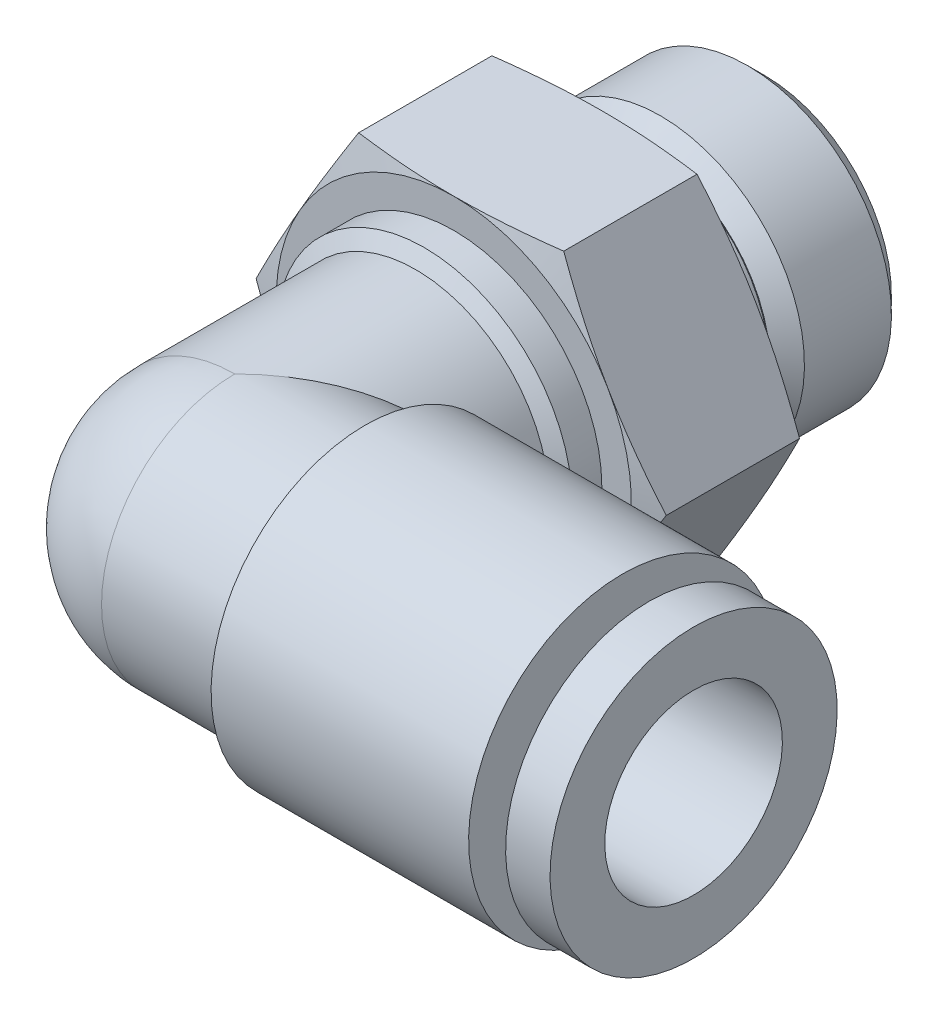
ISO-10303-21;
HEADER;
FILE_DESCRIPTION(('STEP AP214'),'2;1');
FILE_NAME('part.step','',(''),(''),'','','');
FILE_SCHEMA(('AUTOMOTIVE_DESIGN { 1 0 10303 214 1 1 1 1 }'));
ENDSEC;
DATA;
#1=APPLICATION_CONTEXT('core data for automotive mechanical design processes');
#2=APPLICATION_PROTOCOL_DEFINITION('international standard','automotive_design',2000,#1);
#3=PRODUCT_CONTEXT('',#1,'mechanical');
#4=PRODUCT('Part','Part','',(#3));
#5=PRODUCT_RELATED_PRODUCT_CATEGORY('part','',(#4));
#6=PRODUCT_DEFINITION_FORMATION('','',#4);
#7=PRODUCT_DEFINITION_CONTEXT('part definition',#1,'design');
#8=PRODUCT_DEFINITION('design','',#6,#7);
#9=PRODUCT_DEFINITION_SHAPE('','',#8);
#10=(LENGTH_UNIT() NAMED_UNIT(*) SI_UNIT(.MILLI.,.METRE.));
#11=(NAMED_UNIT(*) PLANE_ANGLE_UNIT() SI_UNIT($,.RADIAN.));
#12=(NAMED_UNIT(*) SI_UNIT($,.STERADIAN.) SOLID_ANGLE_UNIT());
#13=UNCERTAINTY_MEASURE_WITH_UNIT(LENGTH_MEASURE(1.E-05),#10,'distance_accuracy_value','');
#14=(GEOMETRIC_REPRESENTATION_CONTEXT(3) GLOBAL_UNCERTAINTY_ASSIGNED_CONTEXT((#13)) GLOBAL_UNIT_ASSIGNED_CONTEXT((#10,
#11,#12)) REPRESENTATION_CONTEXT('',''));
#15=CARTESIAN_POINT('',(0.,0.,0.));
#16=DIRECTION('',(0.,0.,1.));
#17=DIRECTION('',(1.,0.,0.));
#18=AXIS2_PLACEMENT_3D('',#15,#16,#17);
#19=CARTESIAN_POINT('',(0.,0.,-5.5));
#20=DIRECTION('',(0.,0.,-1.));
#21=DIRECTION('',(0.,1.,0.));
#22=AXIS2_PLACEMENT_3D('',#19,#20,#21);
#23=CYLINDRICAL_SURFACE('',#22,4.5);
#24=CARTESIAN_POINT('',(0.,0.,12.4));
#25=DIRECTION('',(-0.707106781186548,0.,-0.707106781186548));
#26=DIRECTION('',(0.707106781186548,0.,-0.707106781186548));
#27=AXIS2_PLACEMENT_3D('',#24,#25,#26);
#28=ELLIPSE('',#27,6.36396103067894,4.5);
#29=CARTESIAN_POINT('',(0.,-4.5,12.4));
#30=VERTEX_POINT('',#29);
#31=CARTESIAN_POINT('',(3.99585481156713,-2.06957588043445,8.40414518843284));
#32=VERTEX_POINT('',#31);
#33=EDGE_CURVE('E429',#30,#32,#28,.F.);
#34=ORIENTED_EDGE('',*,*,#33,.F.);
#35=CARTESIAN_POINT('',(0.,0.,12.4));
#36=DIRECTION('',(0.,0.,-1.));
#37=DIRECTION('',(0.,1.,0.));
#38=AXIS2_PLACEMENT_3D('',#35,#36,#37);
#39=CIRCLE('',#38,4.5);
#40=CARTESIAN_POINT('',(0.,4.49999999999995,12.4));
#41=VERTEX_POINT('',#40);
#42=EDGE_CURVE('E235',#30,#41,#39,.T.);
#43=ORIENTED_EDGE('',*,*,#42,.T.);
#44=CARTESIAN_POINT('',(3.99585481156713,2.06957588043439,8.40414518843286));
#45=VERTEX_POINT('',#44);
#46=EDGE_CURVE('E433',#45,#41,#28,.F.);
#47=ORIENTED_EDGE('',*,*,#46,.F.);
#48=CARTESIAN_POINT('',(4.44061451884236,0.728658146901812,7.1802673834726));
#49=CARTESIAN_POINT('',(4.42805963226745,0.805158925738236,7.21290643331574));
#50=CARTESIAN_POINT('',(4.41386580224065,0.87930945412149,7.24992755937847));
#51=CARTESIAN_POINT('',(4.38287152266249,1.02264021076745,7.33121359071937));
#52=CARTESIAN_POINT('',(4.36607986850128,1.09183609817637,7.37545408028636));
#53=CARTESIAN_POINT('',(4.3134267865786,1.28946442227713,7.51509172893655));
#54=CARTESIAN_POINT('',(4.27469679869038,1.41119872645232,7.61892156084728));
#55=CARTESIAN_POINT('',(4.21240219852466,1.58419916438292,7.78889831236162));
#56=CARTESIAN_POINT('',(4.19031405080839,1.64159314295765,7.84968274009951));
#57=CARTESIAN_POINT('',(4.14532365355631,1.7520986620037,7.97477650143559));
#58=CARTESIAN_POINT('',(4.12242141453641,1.8052102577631,8.03908578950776));
#59=CARTESIAN_POINT('',(4.07558727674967,1.90863619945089,8.17215445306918));
#60=CARTESIAN_POINT('',(4.05164382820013,1.95885554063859,8.24098287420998));
#61=CARTESIAN_POINT('',(4.00354091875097,2.05536901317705,8.38117834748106));
#62=CARTESIAN_POINT('',(3.97938165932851,2.10166645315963,8.45254318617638));
#63=CARTESIAN_POINT('',(3.95524029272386,2.14617665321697,8.52498300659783));
#64=B_SPLINE_CURVE_WITH_KNOTS('',3,(#48,#49,#50,#51,#52,#53,#54,#55,#56,#57,#58,#59,#60,#61,#62,
#63),.UNSPECIFIED.,.F.,.F.,(4,2,2,2,2,2,2,4),(0.,0.251885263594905,0.502935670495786,
0.994291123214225,1.25358678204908,1.51287909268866,1.77826175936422,2.04341826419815),.UNSPECIFIED.);
#65=CARTESIAN_POINT('',(4.4,0.943398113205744,7.28629292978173));
#66=VERTEX_POINT('',#65);
#67=EDGE_CURVE('E30',#66,#45,#64,.T.);
#68=ORIENTED_EDGE('',*,*,#67,.F.);
#69=CARTESIAN_POINT('',(0.,4.5,9.79423715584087));
#70=CARTESIAN_POINT('',(-0.074177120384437,4.50000116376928,9.79424064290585));
#71=CARTESIAN_POINT('',(-0.148341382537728,4.49816051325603,9.79105250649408));
#72=CARTESIAN_POINT('',(-0.29597544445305,4.49086516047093,9.77851563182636));
#73=CARTESIAN_POINT('',(-0.369445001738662,4.48540924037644,9.7691648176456));
#74=CARTESIAN_POINT('',(-0.588202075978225,4.46379451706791,9.732535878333));
#75=CARTESIAN_POINT('',(-0.731599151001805,4.44238946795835,9.69668380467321));
#76=CARTESIAN_POINT('',(-0.970629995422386,4.39525654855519,9.62095776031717));
#77=CARTESIAN_POINT('',(-1.0682528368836,4.37248763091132,9.58512483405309));
#78=CARTESIAN_POINT('',(-1.25942999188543,4.32129708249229,9.50715168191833));
#79=CARTESIAN_POINT('',(-1.35298354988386,4.29287440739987,9.46501029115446));
#80=CARTESIAN_POINT('',(-1.53640554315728,4.23070646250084,9.37608299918));
#81=CARTESIAN_POINT('',(-1.62626044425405,4.19694351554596,9.32928187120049));
#82=CARTESIAN_POINT('',(-1.80217648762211,4.12446382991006,9.23259503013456));
#83=CARTESIAN_POINT('',(-1.88823852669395,4.0857482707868,9.18271005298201));
#84=CARTESIAN_POINT('',(-2.10335888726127,3.98083980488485,9.05288265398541));
#85=CARTESIAN_POINT('',(-2.22993970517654,3.91127266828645,8.97154290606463));
#86=CARTESIAN_POINT('',(-2.47515379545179,3.76089098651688,8.80721041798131));
#87=CARTESIAN_POINT('',(-2.5937829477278,3.68007067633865,8.72421684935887));
#88=CARTESIAN_POINT('',(-2.82300901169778,3.50730470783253,8.55902619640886));
#89=CARTESIAN_POINT('',(-2.9336143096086,3.41537094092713,8.47682836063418));
#90=CARTESIAN_POINT('',(-3.14650821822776,3.22029858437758,8.31518250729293));
#91=CARTESIAN_POINT('',(-3.24880039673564,3.11716484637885,8.23573331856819));
#92=CARTESIAN_POINT('',(-3.49793615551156,2.84001053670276,8.03916571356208));
#93=CARTESIAN_POINT('',(-3.63860130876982,2.65803689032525,7.92517122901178));
#94=CARTESIAN_POINT('',(-3.89389289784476,2.26756271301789,7.71521803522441));
#95=CARTESIAN_POINT('',(-4.00856287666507,2.05910746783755,7.61922921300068));
#96=CARTESIAN_POINT('',(-4.1878274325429,1.65858046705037,7.46785590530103));
#97=CARTESIAN_POINT('',(-4.25775246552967,1.47054281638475,7.40825079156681));
#98=CARTESIAN_POINT('',(-4.3439534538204,1.17914126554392,7.33445779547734));
#99=CARTESIAN_POINT('',(-4.36957716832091,1.0804214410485,7.3124586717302));
#100=CARTESIAN_POINT('',(-4.41421472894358,0.880445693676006,7.27406982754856));
#101=CARTESIAN_POINT('',(-4.43323133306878,0.779190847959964,7.25767776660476));
#102=CARTESIAN_POINT('',(-4.464415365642,0.574280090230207,7.2307696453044));
#103=CARTESIAN_POINT('',(-4.47654459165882,0.470614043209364,7.22028636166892));
#104=CARTESIAN_POINT('',(-4.4935643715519,0.262287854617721,7.20557006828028));
#105=CARTESIAN_POINT('',(-4.49845796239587,0.157628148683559,7.20133443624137));
#106=CARTESIAN_POINT('',(-4.50092042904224,-0.0518521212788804,7.19920348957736));
#107=CARTESIAN_POINT('',(-4.49848859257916,-0.156672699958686,7.20130879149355));
#108=CARTESIAN_POINT('',(-4.48634669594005,-0.365567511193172,7.21181173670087));
#109=CARTESIAN_POINT('',(-4.47663698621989,-0.469641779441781,7.22020907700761));
#110=CARTESIAN_POINT('',(-4.45119863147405,-0.667821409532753,7.24217763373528));
#111=CARTESIAN_POINT('',(-4.43602165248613,-0.762051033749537,7.25527430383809));
#112=CARTESIAN_POINT('',(-4.3999113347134,-0.948588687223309,7.28637730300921));
#113=CARTESIAN_POINT('',(-4.37897605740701,-1.04089605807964,7.30438528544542));
#114=CARTESIAN_POINT('',(-4.30796261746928,-1.31406895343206,7.36532624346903));
#115=CARTESIAN_POINT('',(-4.2496560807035,-1.49134215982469,7.41519432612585));
#116=CARTESIAN_POINT('',(-4.10900654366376,-1.84526535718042,7.53456535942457));
#117=CARTESIAN_POINT('',(-4.02522535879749,-2.0209349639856,7.60523132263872));
#118=CARTESIAN_POINT('',(-3.83904361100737,-2.35551035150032,7.76043105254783));
#119=CARTESIAN_POINT('',(-3.73663070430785,-2.51440490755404,7.84497400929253));
#120=CARTESIAN_POINT('',(-3.54310341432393,-2.77780928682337,8.00213388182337));
#121=CARTESIAN_POINT('',(-3.45534415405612,-2.88612021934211,8.07261624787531));
#122=CARTESIAN_POINT('',(-3.27177047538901,-3.09266968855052,8.21773797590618));
#123=CARTESIAN_POINT('',(-3.17595553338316,-3.19090756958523,8.29237760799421));
#124=CARTESIAN_POINT('',(-2.97668032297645,-3.37758329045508,8.4444389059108));
#125=CARTESIAN_POINT('',(-2.8732010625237,-3.46599532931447,8.52186722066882));
#126=CARTESIAN_POINT('',(-2.65917493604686,-3.63279441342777,8.67766014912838));
#127=CARTESIAN_POINT('',(-2.54863010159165,-3.71118432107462,8.75602448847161));
#128=CARTESIAN_POINT('',(-2.34094735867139,-3.84478198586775,8.89780586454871));
#129=CARTESIAN_POINT('',(-2.2449649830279,-3.90162514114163,8.96138087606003));
#130=CARTESIAN_POINT('',(-2.04802461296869,-4.00851015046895,9.08660019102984));
#131=CARTESIAN_POINT('',(-1.94706558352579,-4.05855058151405,9.14824408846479));
#132=CARTESIAN_POINT('',(-1.7401353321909,-4.15147679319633,9.26775633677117));
#133=CARTESIAN_POINT('',(-1.63417802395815,-4.19438108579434,9.32563421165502));
#134=CARTESIAN_POINT('',(-1.4166772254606,-4.27274843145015,9.43551508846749));
#135=CARTESIAN_POINT('',(-1.30513800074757,-4.30821706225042,9.48752248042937));
#136=CARTESIAN_POINT('',(-1.06019928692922,-4.37541388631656,9.58931282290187));
#137=CARTESIAN_POINT('',(-0.925908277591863,-4.40594885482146,9.6377964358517));
#138=CARTESIAN_POINT('',(-0.650319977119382,-4.45494866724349,9.71752773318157));
#139=CARTESIAN_POINT('',(-0.509041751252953,-4.47344459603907,9.74881977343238));
#140=CARTESIAN_POINT('',(-0.220330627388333,-4.49695208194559,9.78886276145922));
#141=CARTESIAN_POINT('',(-0.0728458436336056,-4.50180711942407,9.79735201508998));
#142=CARTESIAN_POINT('',(0.221184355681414,-4.49697033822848,9.78901161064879));
#143=CARTESIAN_POINT('',(0.367729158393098,-4.48726984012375,9.77216684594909));
#144=CARTESIAN_POINT('',(0.677248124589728,-4.45188842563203,9.71262345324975));
#145=CARTESIAN_POINT('',(0.83922690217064,-4.42395415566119,9.66630715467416));
#146=CARTESIAN_POINT('',(1.15301281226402,-4.35277542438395,9.55435440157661));
#147=CARTESIAN_POINT('',(1.30477999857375,-4.30947457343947,9.48864694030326));
#148=CARTESIAN_POINT('',(1.57659508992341,-4.21684926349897,9.35635918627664));
#149=CARTESIAN_POINT('',(1.6980374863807,-4.16932940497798,9.29130926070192));
#150=CARTESIAN_POINT('',(1.93417129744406,-4.06517479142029,9.15629429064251));
#151=CARTESIAN_POINT('',(2.0488580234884,-4.00853380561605,9.08632590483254));
#152=CARTESIAN_POINT('',(2.27202432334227,-3.8863997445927,8.94388648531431));
#153=CARTESIAN_POINT('',(2.3804949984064,-3.82089440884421,8.87141209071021));
#154=CARTESIAN_POINT('',(2.59126210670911,-3.68121404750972,8.72592390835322));
#155=CARTESIAN_POINT('',(2.69356003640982,-3.60704113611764,8.65291025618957));
#156=CARTESIAN_POINT('',(2.89812796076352,-3.44512778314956,8.50333690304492));
#157=CARTESIAN_POINT('',(3.00000363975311,-3.3568314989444,8.42683773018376));
#158=CARTESIAN_POINT('',(3.19645226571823,-3.17033742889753,8.27649222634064));
#159=CARTESIAN_POINT('',(3.29102382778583,-3.07213777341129,8.20264639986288));
#160=CARTESIAN_POINT('',(3.47197907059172,-2.86602625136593,8.05930884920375));
#161=CARTESIAN_POINT('',(3.55838214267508,-2.75813863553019,7.98980695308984));
#162=CARTESIAN_POINT('',(3.72230660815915,-2.53256749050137,7.856510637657));
#163=CARTESIAN_POINT('',(3.79982831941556,-2.41488431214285,7.79271601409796));
#164=CARTESIAN_POINT('',(3.97599542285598,-2.11724788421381,7.64656155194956));
#165=CARTESIAN_POINT('',(4.06945875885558,-1.93221965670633,7.56795968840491));
#166=CARTESIAN_POINT('',(4.1911100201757,-1.64184412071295,7.46492661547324));
#167=CARTESIAN_POINT('',(4.22857712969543,-1.54288606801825,7.43305420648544));
#168=CARTESIAN_POINT('',(4.29682228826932,-1.34113279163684,7.37482713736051));
#169=CARTESIAN_POINT('',(4.32760364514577,-1.23833949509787,7.34846974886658));
#170=CARTESIAN_POINT('',(4.38220569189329,-1.02864576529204,7.30161504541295));
#171=CARTESIAN_POINT('',(4.4059659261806,-0.921718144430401,7.28116865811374));
#172=CARTESIAN_POINT('',(4.44572269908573,-0.705429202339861,7.24690885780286));
#173=CARTESIAN_POINT('',(4.46172308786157,-0.596069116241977,7.23309215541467));
#174=CARTESIAN_POINT('',(4.48564447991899,-0.37584323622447,7.21242155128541));
#175=CARTESIAN_POINT('',(4.49356770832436,-0.264977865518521,7.20556573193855));
#176=CARTESIAN_POINT('',(4.50116953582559,-0.04275888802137,7.19898824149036));
#177=CARTESIAN_POINT('',(4.50084902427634,0.0685946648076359,7.19926580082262));
#178=CARTESIAN_POINT('',(4.4925056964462,0.277447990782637,7.2064844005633));
#179=CARTESIAN_POINT('',(4.48540699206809,0.375014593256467,7.21262596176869));
#180=CARTESIAN_POINT('',(4.46494445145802,0.569024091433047,7.23030925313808));
#181=CARTESIAN_POINT('',(4.45157866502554,0.665466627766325,7.24185266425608));
#182=CARTESIAN_POINT('',(4.4187977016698,0.856513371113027,7.27011657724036));
#183=CARTESIAN_POINT('',(4.39938443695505,0.951118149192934,7.28683544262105));
#184=CARTESIAN_POINT('',(4.35479862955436,1.13796749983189,7.32514604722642));
#185=CARTESIAN_POINT('',(4.32962388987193,1.23021115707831,7.34673964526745));
#186=CARTESIAN_POINT('',(4.24524082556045,1.50494990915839,7.41891567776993));
#187=CARTESIAN_POINT('',(4.17758643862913,1.68310027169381,7.47653432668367));
#188=CARTESIAN_POINT('',(4.02311241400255,2.02480188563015,7.60690961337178));
#189=CARTESIAN_POINT('',(3.93628504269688,2.18834720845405,7.67967235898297));
#190=CARTESIAN_POINT('',(3.77156866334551,2.45829830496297,7.81598425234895));
#191=CARTESIAN_POINT('',(3.69739623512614,2.56837080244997,7.87687490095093));
#192=CARTESIAN_POINT('',(3.5412202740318,2.77975326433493,8.00362012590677));
#193=CARTESIAN_POINT('',(3.45921624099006,2.88106266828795,8.06947501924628));
#194=CARTESIAN_POINT('',(3.2879228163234,3.07512022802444,8.20504051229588));
#195=CARTESIAN_POINT('',(3.19861407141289,3.16784415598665,8.27476118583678));
#196=CARTESIAN_POINT('',(3.01346595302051,3.34445664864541,8.41660525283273));
#197=CARTESIAN_POINT('',(2.91762754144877,3.42834651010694,8.48872829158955));
#198=CARTESIAN_POINT('',(2.71772654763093,3.5889742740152,8.63551679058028));
#199=CARTESIAN_POINT('',(2.61353725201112,3.66553422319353,8.71020420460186));
#200=CARTESIAN_POINT('',(2.39869795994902,3.80959107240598,8.85913179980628));
#201=CARTESIAN_POINT('',(2.28804579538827,3.87708490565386,8.93337182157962));
#202=CARTESIAN_POINT('',(2.06028473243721,4.00276418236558,9.07928861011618));
#203=CARTESIAN_POINT('',(1.94318779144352,4.06096613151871,9.15096974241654));
#204=CARTESIAN_POINT('',(1.70193725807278,4.16782864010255,9.28923964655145));
#205=CARTESIAN_POINT('',(1.57778955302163,4.21649701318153,9.35583256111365));
#206=CARTESIAN_POINT('',(1.31087320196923,4.30733797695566,9.48562115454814));
#207=CARTESIAN_POINT('',(1.16741726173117,4.34861586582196,9.54805596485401));
#208=CARTESIAN_POINT('',(0.87126579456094,4.41744212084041,9.65585370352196));
#209=CARTESIAN_POINT('',(0.718605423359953,4.44503942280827,9.70127733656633));
#210=CARTESIAN_POINT('',(0.470385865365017,4.47630972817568,9.75365175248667));
#211=CARTESIAN_POINT('',(0.377187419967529,4.48515460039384,9.76874254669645));
#212=CARTESIAN_POINT('',(0.189318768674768,4.49699830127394,9.78903185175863));
#213=CARTESIAN_POINT('',(0.0946489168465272,4.49999851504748,9.79423270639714));
#214=CARTESIAN_POINT('',(0.,4.5,9.79423715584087));
#215=B_SPLINE_CURVE_WITH_KNOTS('',3,(#69,#70,#71,#72,#73,#74,#75,#76,#77,#78,#79,#80,#81,#82,
#83,#84,#85,#86,#87,#88,#89,#90,#91,#92,#93,#94,#95,#96,#97,#98,#99,#100,#101,#102,#103,#104,
#105,#106,#107,#108,#109,#110,#111,#112,#113,#114,#115,#116,#117,#118,#119,#120,#121,#122,#123,
#124,#125,#126,#127,#128,#129,#130,#131,#132,#133,#134,#135,#136,#137,#138,#139,#140,#141,#142,
#143,#144,#145,#146,#147,#148,#149,#150,#151,#152,#153,#154,#155,#156,#157,#158,#159,#160,#161,
#162,#163,#164,#165,#166,#167,#168,#169,#170,#171,#172,#173,#174,#175,#176,#177,#178,#179,#180,
#181,#182,#183,#184,#185,#186,#187,#188,#189,#190,#191,#192,#193,#194,#195,#196,#197,#198,#199,
#200,#201,#202,#203,#204,#205,#206,#207,#208,#209,#210,#211,#212,#213,#214),.UNSPECIFIED.,.T.,
.F.,(4,2,2,2,2,2,2,2,2,2,2,2,2,2,2,2,2,2,2,2,2,2,2,2,2,2,2,2,2,2,2,2,2,2,2,2,2,2,2,2,2,2,2,2,2,
2,2,2,2,2,2,2,2,2,2,2,2,2,2,2,2,2,2,2,2,2,2,2,2,2,2,2,4),(0.,0.2224146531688,0.444904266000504,
0.890588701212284,1.20956830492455,1.52860688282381,1.8487245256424,2.16876606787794,
2.66539670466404,3.16228270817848,3.65864167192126,4.15478647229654,4.92188954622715,
5.68769803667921,6.31270944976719,6.62538734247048,6.93793455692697,7.25219886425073,
7.56633122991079,7.88049414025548,8.19464192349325,8.483326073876,8.77210752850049,
9.34919799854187,9.96820218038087,10.5876179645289,11.0556609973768,11.5237344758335,
11.9930093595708,12.4621499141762,12.8470744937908,13.2320794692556,13.6160695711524,
13.9997705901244,14.4364671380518,14.87203161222,15.3125738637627,15.7533789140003,
16.2628297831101,16.7741698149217,17.2107952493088,17.6477202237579,18.0852558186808,
18.5226849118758,18.9872122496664,19.4518274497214,19.9153104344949,20.3787768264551,
21.0408346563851,21.3720354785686,21.7030720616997,22.0368811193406,22.3705243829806,
22.7040757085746,23.0375910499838,23.331289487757,23.6250793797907,23.9187764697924,
24.2125857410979,24.8073679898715,25.4023905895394,25.8399282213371,26.2774938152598,
26.7162587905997,27.1549592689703,27.6024904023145,28.0501725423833,28.497050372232,
28.9435603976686,29.42774905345,29.9101930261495,30.1940581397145,30.4778559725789),.UNSPECIFIED.);
#216=CARTESIAN_POINT('',(4.47213595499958,0.499999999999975,7.22409428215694));
#217=VERTEX_POINT('',#216);
#218=EDGE_CURVE('E436',#217,#66,#215,.T.);
#219=ORIENTED_EDGE('',*,*,#218,.F.);
#220=DIRECTION('',(0.,0.,-1.));
#221=VECTOR('',#220,1.);
#222=CARTESIAN_POINT('',(4.47213595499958,0.500000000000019,-5.5));
#223=LINE('',#222,#221);
#224=CARTESIAN_POINT('',(4.47213595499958,0.499999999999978,6.28867513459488));
#225=VERTEX_POINT('',#224);
#226=EDGE_CURVE('E182',#225,#217,#223,.F.);
#227=ORIENTED_EDGE('',*,*,#226,.F.);
#228=CARTESIAN_POINT('',(0.,0.,6.28867513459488));
#229=DIRECTION('',(0.,0.,-1.));
#230=DIRECTION('',(0.,1.,0.));
#231=AXIS2_PLACEMENT_3D('',#228,#229,#230);
#232=CIRCLE('',#231,4.5);
#233=CARTESIAN_POINT('',(4.47213595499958,-0.500000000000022,6.28867513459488));
#234=VERTEX_POINT('',#233);
#235=EDGE_CURVE('E514',#234,#225,#232,.T.);
#236=ORIENTED_EDGE('',*,*,#235,.F.);
#237=DIRECTION('',(0.,0.,-1.));
#238=VECTOR('',#237,1.);
#239=CARTESIAN_POINT('',(4.47213595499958,-0.499999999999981,-5.5));
#240=LINE('',#239,#238);
#241=CARTESIAN_POINT('',(4.47213595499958,-0.500000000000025,7.22409428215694));
#242=VERTEX_POINT('',#241);
#243=EDGE_CURVE('E410',#234,#242,#240,.F.);
#244=ORIENTED_EDGE('',*,*,#243,.T.);
#245=CARTESIAN_POINT('',(4.4000000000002,-0.943398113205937,7.28629292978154));
#246=VERTEX_POINT('',#245);
#247=EDGE_CURVE('E43',#246,#242,#215,.T.);
#248=ORIENTED_EDGE('',*,*,#247,.F.);
#249=CARTESIAN_POINT('',(3.95524029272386,-2.14617665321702,8.52498300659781));
#250=CARTESIAN_POINT('',(3.9829022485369,-2.09516313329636,8.44197847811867));
#251=CARTESIAN_POINT('',(4.01059497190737,-2.04180603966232,8.36036507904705));
#252=CARTESIAN_POINT('',(4.06567736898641,-1.92982149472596,8.20045825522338));
#253=CARTESIAN_POINT('',(4.09306626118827,-1.87118293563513,8.12217236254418));
#254=CARTESIAN_POINT('',(4.14630495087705,-1.7499724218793,7.9719346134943));
#255=CARTESIAN_POINT('',(4.1721763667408,-1.68755464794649,7.89986730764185));
#256=CARTESIAN_POINT('',(4.22264256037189,-1.55698155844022,7.76075741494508));
#257=CARTESIAN_POINT('',(4.24723818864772,-1.48883014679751,7.69371146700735));
#258=CARTESIAN_POINT('',(4.30430179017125,-1.31689899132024,7.53951512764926));
#259=CARTESIAN_POINT('',(4.33585947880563,-1.20997352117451,7.45540204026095));
#260=CARTESIAN_POINT('',(4.37890533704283,-1.03862253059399,7.34166065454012));
#261=CARTESIAN_POINT('',(4.39264914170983,-0.979053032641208,7.30553403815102));
#262=CARTESIAN_POINT('',(4.41819622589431,-0.856431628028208,7.23863487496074));
#263=CARTESIAN_POINT('',(4.42999539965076,-0.793372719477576,7.20787364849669));
#264=CARTESIAN_POINT('',(4.44061451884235,-0.728658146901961,7.18026738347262));
#265=B_SPLINE_CURVE_WITH_KNOTS('',3,(#249,#250,#251,#252,#253,#254,#255,#256,#257,#258,#259,
#260,#261,#262,#263,#264),.UNSPECIFIED.,.F.,.F.,(4,2,2,2,2,2,2,4),(0.,0.303869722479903,
0.608394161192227,0.904473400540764,1.20035265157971,1.617624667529,1.83037852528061,
2.04357597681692),.UNSPECIFIED.);
#266=EDGE_CURVE('E11',#32,#246,#265,.T.);
#267=ORIENTED_EDGE('',*,*,#266,.F.);
#268=EDGE_LOOP('',(#34,#43,#47,#68,#219,#227,#236,#244,#248,#267));
#269=FACE_BOUND('',#268,.T.);
#270=ADVANCED_FACE('F17',(#269),#23,.T.);
#271=CARTESIAN_POINT('',(0.,-0.5,0.));
#272=DIRECTION('',(0.,-1.,0.));
#273=DIRECTION('',(1.,0.,0.));
#274=AXIS2_PLACEMENT_3D('',#271,#272,#273);
#275=PLANE('',#274);
#276=DIRECTION('',(0.,0.,1.));
#277=VECTOR('',#276,1.);
#278=CARTESIAN_POINT('',(5.,-0.500000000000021,6.));
#279=LINE('',#278,#277);
#280=CARTESIAN_POINT('',(5.,-0.500000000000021,6.));
#281=VERTEX_POINT('',#280);
#282=CARTESIAN_POINT('',(5.,-0.500000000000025,7.22409428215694));
#283=VERTEX_POINT('',#282);
#284=EDGE_CURVE('E430',#281,#283,#279,.T.);
#285=ORIENTED_EDGE('',*,*,#284,.T.);
#286=DIRECTION('',(1.,0.,0.));
#287=VECTOR('',#286,1.);
#288=CARTESIAN_POINT('',(15.5,-0.500000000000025,7.22409428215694));
#289=LINE('',#288,#287);
#290=EDGE_CURVE('E185',#283,#242,#289,.F.);
#291=ORIENTED_EDGE('',*,*,#290,.T.);
#292=ORIENTED_EDGE('',*,*,#243,.F.);
#293=CARTESIAN_POINT('',(4.97615572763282,-0.500000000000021,5.9993));
#294=CARTESIAN_POINT('',(4.70565348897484,-0.500000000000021,6.15466328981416));
#295=CARTESIAN_POINT('',(4.43512016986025,-0.500000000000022,6.30997265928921));
#296=CARTESIAN_POINT('',(3.89381064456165,-0.500000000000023,6.62028427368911));
#297=CARTESIAN_POINT('',(3.62303440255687,-0.500000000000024,6.77528645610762));
#298=CARTESIAN_POINT('',(3.08419687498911,-0.500000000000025,7.0829915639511));
#299=CARTESIAN_POINT('',(2.81613919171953,-0.500000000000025,7.23570078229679));
#300=CARTESIAN_POINT('',(2.41352645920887,-0.500000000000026,7.46378851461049));
#301=CARTESIAN_POINT('',(2.27924484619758,-0.500000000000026,7.53964928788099));
#302=CARTESIAN_POINT('',(2.01037922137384,-0.500000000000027,7.6908319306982));
#303=CARTESIAN_POINT('',(1.87579521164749,-0.500000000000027,7.76615380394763));
#304=CARTESIAN_POINT('',(1.64741429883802,-0.500000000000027,7.89288504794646));
#305=CARTESIAN_POINT('',(1.55375854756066,-0.500000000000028,7.94454808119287));
#306=CARTESIAN_POINT('',(1.36599017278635,-0.500000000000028,8.04710794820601));
#307=CARTESIAN_POINT('',(1.27187741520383,-0.500000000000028,8.09800453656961));
#308=CARTESIAN_POINT('',(1.0822212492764,-0.500000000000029,8.19881497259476));
#309=CARTESIAN_POINT('',(0.986672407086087,-0.500000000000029,8.24871872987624));
#310=CARTESIAN_POINT('',(0.842276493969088,-0.500000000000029,8.32139193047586));
#311=CARTESIAN_POINT('',(0.793979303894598,-0.500000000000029,8.34524627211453));
#312=CARTESIAN_POINT('',(0.696846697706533,-0.500000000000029,8.39182630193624));
#313=CARTESIAN_POINT('',(0.64801131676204,-0.50000000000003,8.41455206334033));
#314=CARTESIAN_POINT('',(0.560087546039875,-0.50000000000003,8.45351250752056));
#315=CARTESIAN_POINT('',(0.521157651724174,-0.50000000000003,8.47009324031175));
#316=CARTESIAN_POINT('',(0.442623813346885,-0.50000000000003,8.50156268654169));
#317=CARTESIAN_POINT('',(0.40301937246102,-0.50000000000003,8.51645008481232));
#318=CARTESIAN_POINT('',(0.283651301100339,-0.50000000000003,8.55692970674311));
#319=CARTESIAN_POINT('',(0.202328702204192,-0.50000000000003,8.57883287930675));
#320=CARTESIAN_POINT('',(0.0996659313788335,-0.50000000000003,8.59260712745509));
#321=CARTESIAN_POINT('',(0.079726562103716,-0.50000000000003,8.5946505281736));
#322=CARTESIAN_POINT('',(0.0396270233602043,-0.50000000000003,8.59740420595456));
#323=CARTESIAN_POINT('',(0.01946626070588,-0.50000000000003,8.59810574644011));
#324=CARTESIAN_POINT('',(-0.000699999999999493,-0.50000000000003,8.59807592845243));
#325=B_SPLINE_CURVE_WITH_KNOTS('',3,(#293,#294,#295,#296,#297,#298,#299,#300,#301,#302,#303,
#304,#305,#306,#307,#308,#309,#310,#311,#312,#313,#314,#315,#316,#317,#318,#319,#320,#321,#322,
#323,#324),.UNSPECIFIED.,.F.,.F.,(4,2,2,2,2,2,2,2,2,2,2,2,2,2,2,4),(0.,0.935832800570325,
1.87183968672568,2.7973511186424,3.26003577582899,3.72271725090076,4.04359489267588,
4.36457317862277,4.68793243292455,4.84952237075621,5.01110181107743,5.13798936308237,
5.26497480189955,5.51559013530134,5.57567672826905,5.63615321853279),.UNSPECIFIED.);
#326=CARTESIAN_POINT('',(4.9749371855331,-0.500000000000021,6.));
#327=VERTEX_POINT('',#326);
#328=EDGE_CURVE('E191',#327,#234,#325,.T.);
#329=ORIENTED_EDGE('',*,*,#328,.F.);
#330=DIRECTION('',(1.,0.,0.));
#331=VECTOR('',#330,1.);
#332=CARTESIAN_POINT('',(0.,-0.500000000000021,6.));
#333=LINE('',#332,#331);
#334=EDGE_CURVE('E174',#327,#281,#333,.T.);
#335=ORIENTED_EDGE('',*,*,#334,.T.);
#336=EDGE_LOOP('',(#285,#291,#292,#329,#335));
#337=FACE_BOUND('',#336,.T.);
#338=ADVANCED_FACE('F220',(#337),#275,.T.);
#339=CARTESIAN_POINT('',(0.,0.5,0.));
#340=DIRECTION('',(0.,-1.,0.));
#341=DIRECTION('',(1.,0.,0.));
#342=AXIS2_PLACEMENT_3D('',#339,#340,#341);
#343=PLANE('',#342);
#344=DIRECTION('',(1.,0.,0.));
#345=VECTOR('',#344,1.);
#346=CARTESIAN_POINT('',(15.5,0.499999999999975,7.22409428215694));
#347=LINE('',#346,#345);
#348=CARTESIAN_POINT('',(5.,0.499999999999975,7.22409428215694));
#349=VERTEX_POINT('',#348);
#350=EDGE_CURVE('E179',#349,#217,#347,.F.);
#351=ORIENTED_EDGE('',*,*,#350,.F.);
#352=DIRECTION('',(0.,0.,1.));
#353=VECTOR('',#352,1.);
#354=CARTESIAN_POINT('',(5.,0.499999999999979,6.));
#355=LINE('',#354,#353);
#356=CARTESIAN_POINT('',(5.,0.499999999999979,6.));
#357=VERTEX_POINT('',#356);
#358=EDGE_CURVE('E162',#357,#349,#355,.T.);
#359=ORIENTED_EDGE('',*,*,#358,.F.);
#360=DIRECTION('',(1.,0.,0.));
#361=VECTOR('',#360,1.);
#362=CARTESIAN_POINT('',(0.,0.499999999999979,6.));
#363=LINE('',#362,#361);
#364=CARTESIAN_POINT('',(4.9749371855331,0.499999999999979,6.));
#365=VERTEX_POINT('',#364);
#366=EDGE_CURVE('E175',#365,#357,#363,.T.);
#367=ORIENTED_EDGE('',*,*,#366,.F.);
#368=CARTESIAN_POINT('',(4.97615572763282,0.499999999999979,5.9993));
#369=CARTESIAN_POINT('',(4.70565348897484,0.499999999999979,6.15466328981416));
#370=CARTESIAN_POINT('',(4.43512016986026,0.499999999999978,6.30997265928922));
#371=CARTESIAN_POINT('',(3.89381064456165,0.499999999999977,6.62028427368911));
#372=CARTESIAN_POINT('',(3.62303440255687,0.499999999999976,6.77528645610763));
#373=CARTESIAN_POINT('',(3.08419687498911,0.499999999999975,7.08299156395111));
#374=CARTESIAN_POINT('',(2.81613919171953,0.499999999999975,7.23570078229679));
#375=CARTESIAN_POINT('',(2.41352645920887,0.499999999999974,7.4637885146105));
#376=CARTESIAN_POINT('',(2.27924484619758,0.499999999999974,7.53964928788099));
#377=CARTESIAN_POINT('',(2.01037922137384,0.499999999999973,7.6908319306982));
#378=CARTESIAN_POINT('',(1.87579521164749,0.499999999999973,7.76615380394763));
#379=CARTESIAN_POINT('',(1.64741429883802,0.499999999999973,7.89288504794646));
#380=CARTESIAN_POINT('',(1.55375854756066,0.499999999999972,7.94454808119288));
#381=CARTESIAN_POINT('',(1.36599017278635,0.499999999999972,8.04710794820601));
#382=CARTESIAN_POINT('',(1.27187741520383,0.499999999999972,8.09800453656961));
#383=CARTESIAN_POINT('',(1.0822212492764,0.499999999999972,8.19881497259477));
#384=CARTESIAN_POINT('',(0.986672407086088,0.499999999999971,8.24871872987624));
#385=CARTESIAN_POINT('',(0.84227649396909,0.499999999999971,8.32139193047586));
#386=CARTESIAN_POINT('',(0.793979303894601,0.499999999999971,8.34524627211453));
#387=CARTESIAN_POINT('',(0.696846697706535,0.499999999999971,8.39182630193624));
#388=CARTESIAN_POINT('',(0.648011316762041,0.499999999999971,8.41455206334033));
#389=CARTESIAN_POINT('',(0.560087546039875,0.499999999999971,8.45351250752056));
#390=CARTESIAN_POINT('',(0.521157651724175,0.499999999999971,8.47009324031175));
#391=CARTESIAN_POINT('',(0.442623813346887,0.49999999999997,8.5015626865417));
#392=CARTESIAN_POINT('',(0.403019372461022,0.49999999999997,8.51645008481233));
#393=CARTESIAN_POINT('',(0.283651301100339,0.49999999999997,8.55692970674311));
#394=CARTESIAN_POINT('',(0.202328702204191,0.49999999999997,8.57883287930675));
#395=CARTESIAN_POINT('',(0.0996659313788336,0.49999999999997,8.59260712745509));
#396=CARTESIAN_POINT('',(0.0797265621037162,0.49999999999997,8.5946505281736));
#397=CARTESIAN_POINT('',(0.0396270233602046,0.49999999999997,8.59740420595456));
#398=CARTESIAN_POINT('',(0.0194662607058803,0.49999999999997,8.59810574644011));
#399=CARTESIAN_POINT('',(-0.000699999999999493,0.49999999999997,8.59807592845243));
#400=B_SPLINE_CURVE_WITH_KNOTS('',3,(#368,#369,#370,#371,#372,#373,#374,#375,#376,#377,#378,
#379,#380,#381,#382,#383,#384,#385,#386,#387,#388,#389,#390,#391,#392,#393,#394,#395,#396,#397,
#398,#399),.UNSPECIFIED.,.F.,.F.,(4,2,2,2,2,2,2,2,2,2,2,2,2,2,2,4),(0.,0.935832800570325,
1.87183968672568,2.7973511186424,3.26003577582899,3.72271725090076,4.04359489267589,
4.36457317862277,4.68793243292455,4.84952237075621,5.01110181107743,5.13798936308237,
5.26497480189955,5.51559013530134,5.57567672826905,5.63615321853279),.UNSPECIFIED.);
#401=EDGE_CURVE('E195',#365,#225,#400,.T.);
#402=ORIENTED_EDGE('',*,*,#401,.T.);
#403=ORIENTED_EDGE('',*,*,#226,.T.);
#404=EDGE_LOOP('',(#351,#359,#367,#402,#403));
#405=FACE_BOUND('',#404,.T.);
#406=ADVANCED_FACE('F180',(#405),#343,.F.);
#407=CARTESIAN_POINT('',(0.,0.,6.28867513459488));
#408=DIRECTION('',(0.,0.,-1.));
#409=DIRECTION('',(0.,1.,0.));
#410=AXIS2_PLACEMENT_3D('',#407,#408,#409);
#411=CONICAL_SURFACE('',#410,4.5,1.0471975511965);
#412=CARTESIAN_POINT('',(0.,0.,6.));
#413=DIRECTION('',(0.,0.,-1.));
#414=DIRECTION('',(0.,1.,0.));
#415=AXIS2_PLACEMENT_3D('',#412,#413,#414);
#416=CIRCLE('',#415,5.);
#417=EDGE_CURVE('E520',#327,#365,#416,.T.);
#418=ORIENTED_EDGE('',*,*,#417,.F.);
#419=ORIENTED_EDGE('',*,*,#328,.T.);
#420=ORIENTED_EDGE('',*,*,#235,.T.);
#421=ORIENTED_EDGE('',*,*,#401,.F.);
#422=EDGE_LOOP('',(#418,#419,#420,#421));
#423=FACE_BOUND('',#422,.T.);
#424=ADVANCED_FACE('F228',(#423),#411,.T.);
#425=CARTESIAN_POINT('',(0.,0.,0.321539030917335));
#426=DIRECTION('',(0.,0.,1.));
#427=DIRECTION('',(0.,-1.,0.));
#428=AXIS2_PLACEMENT_3D('',#425,#426,#427);
#429=CONICAL_SURFACE('',#428,7.2,1.30899693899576);
#430=CARTESIAN_POINT('',(-3.46398614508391,-6.0002,0.248742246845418));
#431=CARTESIAN_POINT('',(-3.60785114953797,-5.75101850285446,0.210177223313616));
#432=CARTESIAN_POINT('',(-3.75197700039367,-5.5013852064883,0.175166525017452));
#433=CARTESIAN_POINT('',(-4.04073770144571,-5.00123700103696,0.113655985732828));
#434=CARTESIAN_POINT('',(-4.18537273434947,-4.75072177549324,0.0871596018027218));
#435=CARTESIAN_POINT('',(-4.47427486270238,-4.25032861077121,0.0442245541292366));
#436=CARTESIAN_POINT('',(-4.61854000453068,-4.00045405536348,0.0277346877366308));
#437=CARTESIAN_POINT('',(-4.90725426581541,-3.5003862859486,0.00562346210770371));
#438=CARTESIAN_POINT('',(-5.05170334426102,-3.2501931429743,0.));
#439=CARTESIAN_POINT('',(-5.34060150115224,-2.7498068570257,0.));
#440=CARTESIAN_POINT('',(-5.48505057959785,-2.4996137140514,0.00562346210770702));
#441=CARTESIAN_POINT('',(-5.77376484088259,-1.99954594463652,0.0277346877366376));
#442=CARTESIAN_POINT('',(-5.91802998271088,-1.74967138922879,0.0442245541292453));
#443=CARTESIAN_POINT('',(-6.20693211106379,-1.24927822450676,0.0871596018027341));
#444=CARTESIAN_POINT('',(-6.35156714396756,-0.998762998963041,0.113655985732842));
#445=CARTESIAN_POINT('',(-6.6403278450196,-0.4986147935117,0.175166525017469));
#446=CARTESIAN_POINT('',(-6.7844536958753,-0.248981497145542,0.210177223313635));
#447=CARTESIAN_POINT('',(-6.92831870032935,0.000199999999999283,0.248742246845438));
#448=B_SPLINE_CURVE_WITH_KNOTS('',3,(#430,#431,#432,#433,#434,#435,#436,#437,#438,#439,#440,
#441,#442,#443,#444,#445,#446,#447),.UNSPECIFIED.,.F.,.F.,(4,2,2,2,2,2,2,2,4),(0.,
0.870954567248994,1.74226232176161,2.60907321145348,3.47571633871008,4.34235946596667,
5.20917035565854,6.08047811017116,6.95143267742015),.UNSPECIFIED.);
#449=CARTESIAN_POINT('',(-5.19615242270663,-3.,0.));
#450=VERTEX_POINT('',#449);
#451=CARTESIAN_POINT('',(-6.92820323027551,0.,0.248711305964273));
#452=VERTEX_POINT('',#451);
#453=EDGE_CURVE('E398',#450,#452,#448,.T.);
#454=ORIENTED_EDGE('',*,*,#453,.T.);
#455=CARTESIAN_POINT('',(-6.92831870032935,-0.00019999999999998,0.248742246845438));
#456=CARTESIAN_POINT('',(-6.7844536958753,0.248981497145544,0.210177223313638));
#457=CARTESIAN_POINT('',(-6.64032784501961,0.498614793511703,0.175166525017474));
#458=CARTESIAN_POINT('',(-6.35156714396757,0.998762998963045,0.113655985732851));
#459=CARTESIAN_POINT('',(-6.2069321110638,1.24927822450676,0.0871596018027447));
#460=CARTESIAN_POINT('',(-5.91802998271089,1.74967138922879,0.0442245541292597));
#461=CARTESIAN_POINT('',(-5.7737648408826,1.99954594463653,0.0277346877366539));
#462=CARTESIAN_POINT('',(-5.48505057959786,2.49961371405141,0.00562346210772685));
#463=CARTESIAN_POINT('',(-5.34060150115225,2.74980685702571,0.));
#464=CARTESIAN_POINT('',(-5.05170334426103,3.2501931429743,0.));
#465=CARTESIAN_POINT('',(-4.90725426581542,3.5003862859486,0.00562346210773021));
#466=CARTESIAN_POINT('',(-4.61854000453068,4.00045405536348,0.0277346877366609));
#467=CARTESIAN_POINT('',(-4.47427486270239,4.25032861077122,0.0442245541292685));
#468=CARTESIAN_POINT('',(-4.18537273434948,4.75072177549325,0.0871596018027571));
#469=CARTESIAN_POINT('',(-4.04073770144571,5.00123700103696,0.113655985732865));
#470=CARTESIAN_POINT('',(-3.75197700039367,5.5013852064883,0.175166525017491));
#471=CARTESIAN_POINT('',(-3.60785114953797,5.75101850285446,0.210177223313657));
#472=CARTESIAN_POINT('',(-3.46398614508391,6.0002,0.248742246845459));
#473=B_SPLINE_CURVE_WITH_KNOTS('',3,(#455,#456,#457,#458,#459,#460,#461,#462,#463,#464,#465,
#466,#467,#468,#469,#470,#471,#472),.UNSPECIFIED.,.F.,.F.,(4,2,2,2,2,2,2,2,4),(0.,
0.870954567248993,1.74226232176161,2.60907321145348,3.47571633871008,4.34235946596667,
5.20917035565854,6.08047811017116,6.95143267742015),.UNSPECIFIED.);
#474=CARTESIAN_POINT('',(-5.19615242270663,3.,0.));
#475=VERTEX_POINT('',#474);
#476=EDGE_CURVE('E560',#452,#475,#473,.T.);
#477=ORIENTED_EDGE('',*,*,#476,.T.);
#478=CARTESIAN_POINT('',(0.,0.,0.));
#479=DIRECTION('',(0.,0.,-1.));
#480=DIRECTION('',(0.,1.,0.));
#481=AXIS2_PLACEMENT_3D('',#478,#479,#480);
#482=CIRCLE('',#481,6.);
#483=EDGE_CURVE('E604',#450,#475,#482,.T.);
#484=ORIENTED_EDGE('',*,*,#483,.F.);
#485=EDGE_LOOP('',(#454,#477,#484));
#486=FACE_BOUND('',#485,.T.);
#487=ADVANCED_FACE('F240',(#486),#429,.T.);
#488=CARTESIAN_POINT('',(0.,6.,0.));
#489=VERTEX_POINT('',#488);
#490=EDGE_CURVE('E596',#475,#489,#482,.T.);
#491=ORIENTED_EDGE('',*,*,#490,.F.);
#492=CARTESIAN_POINT('',(-3.46410161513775,6.,0.248711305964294));
#493=VERTEX_POINT('',#492);
#494=EDGE_CURVE('E319',#475,#493,#473,.T.);
#495=ORIENTED_EDGE('',*,*,#494,.T.);
#496=CARTESIAN_POINT('',(-10.3999621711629,6.,1.60947220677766));
#497=CARTESIAN_POINT('',(-10.147848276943,6.00000000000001,1.55096640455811));
#498=CARTESIAN_POINT('',(-9.89561976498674,6.00000000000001,1.49294954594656));
#499=CARTESIAN_POINT('',(-9.39088575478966,6.00000000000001,1.37811466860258));
#500=CARTESIAN_POINT('',(-9.13838025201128,6.00000000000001,1.32129666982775));
#501=CARTESIAN_POINT('',(-8.63300057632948,6.00000000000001,1.20907080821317));
#502=CARTESIAN_POINT('',(-8.38012633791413,6.00000000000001,1.15366323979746));
#503=CARTESIAN_POINT('',(-7.87400885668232,6.00000000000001,1.04456073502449));
#504=CARTESIAN_POINT('',(-7.62076561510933,6.00000000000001,0.990865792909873));
#505=CARTESIAN_POINT('',(-7.11149577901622,6.00000000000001,0.885057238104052));
#506=CARTESIAN_POINT('',(-6.85546516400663,6.00000000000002,0.832962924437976));
#507=CARTESIAN_POINT('',(-6.34289478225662,6.00000000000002,0.731342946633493));
#508=CARTESIAN_POINT('',(-6.08635501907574,6.00000000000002,0.68181726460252));
#509=CARTESIAN_POINT('',(-5.57266003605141,6.00000000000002,0.585900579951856));
#510=CARTESIAN_POINT('',(-5.31550475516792,6.00000000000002,0.539509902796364));
#511=CARTESIAN_POINT('',(-4.8005265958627,6.00000000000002,0.450571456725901));
#512=CARTESIAN_POINT('',(-4.5427037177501,6.00000000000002,0.408023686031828));
#513=CARTESIAN_POINT('',(-4.03326542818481,6.00000000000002,0.328697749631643));
#514=CARTESIAN_POINT('',(-3.7816695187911,6.00000000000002,0.291795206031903));
#515=CARTESIAN_POINT('',(-3.27773928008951,6.00000000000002,0.223329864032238));
#516=CARTESIAN_POINT('',(-3.02540493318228,6.00000000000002,0.19176719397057));
#517=CARTESIAN_POINT('',(-2.52007981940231,6.00000000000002,0.134968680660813));
#518=CARTESIAN_POINT('',(-2.26708922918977,6.00000000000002,0.109731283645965));
#519=CARTESIAN_POINT('',(-1.76049640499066,6.00000000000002,0.0665420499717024));
#520=CARTESIAN_POINT('',(-1.50689421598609,6.00000000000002,0.0485896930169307));
#521=CARTESIAN_POINT('',(-1.0003305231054,6.00000000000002,0.0208429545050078));
#522=CARTESIAN_POINT('',(-0.747370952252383,6.00000000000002,0.011013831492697));
#523=CARTESIAN_POINT('',(-0.241262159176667,6.00000000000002,-0.000120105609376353));
#524=CARTESIAN_POINT('',(0.0118870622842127,6.00000000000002,-0.00142495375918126));
#525=CARTESIAN_POINT('',(0.518102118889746,6.00000000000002,0.00455941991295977));
#526=CARTESIAN_POINT('',(0.771167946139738,6.00000000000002,0.0118493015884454));
#527=CARTESIAN_POINT('',(1.27692044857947,6.00000000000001,0.0346460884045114));
#528=CARTESIAN_POINT('',(1.52960712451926,6.,0.0501529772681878));
#529=CARTESIAN_POINT('',(2.14203330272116,6.,0.0968756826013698));
#530=CARTESIAN_POINT('',(2.50147683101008,6.00000000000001,0.13197038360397));
#531=CARTESIAN_POINT('',(3.21886402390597,6.00000000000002,0.214673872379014));
#532=CARTESIAN_POINT('',(3.57680774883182,6.00000000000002,0.262282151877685));
#533=CARTESIAN_POINT('',(4.29236116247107,6.00000000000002,0.367410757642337));
#534=CARTESIAN_POINT('',(4.64996629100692,6.00000000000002,0.424961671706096));
#535=CARTESIAN_POINT('',(5.36387848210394,6.00000000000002,0.547524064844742));
#536=CARTESIAN_POINT('',(5.72018555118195,6.00000000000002,0.612535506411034));
#537=CARTESIAN_POINT('',(6.43899103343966,6.00000000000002,0.749580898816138));
#538=CARTESIAN_POINT('',(6.80146708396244,6.00000000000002,0.821731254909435));
#539=CARTESIAN_POINT('',(7.52550798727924,6.00000000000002,0.970462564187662));
#540=CARTESIAN_POINT('',(7.88707283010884,6.00000000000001,1.04704356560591));
#541=CARTESIAN_POINT('',(8.60753271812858,6.00000000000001,1.20315177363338));
#542=CARTESIAN_POINT('',(8.96643168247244,6.00000000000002,1.28266097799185));
#543=CARTESIAN_POINT('',(9.68361637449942,6.00000000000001,1.44428793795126));
#544=CARTESIAN_POINT('',(10.0419021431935,6.00000000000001,1.52640551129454));
#545=CARTESIAN_POINT('',(10.3999621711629,6.,1.60947220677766));
#546=B_SPLINE_CURVE_WITH_KNOTS('',3,(#496,#497,#498,#499,#500,#501,#502,#503,#504,#505,#506,
#507,#508,#509,#510,#511,#512,#513,#514,#515,#516,#517,#518,#519,#520,#521,#522,#523,#524,#525,
#526,#527,#528,#529,#530,#531,#532,#533,#534,#535,#536,#537,#538,#539,#540,#541,#542,#543,#544,
#545),.UNSPECIFIED.,.F.,.F.,(4,2,2,2,2,2,2,2,2,2,2,2,2,2,2,2,2,2,2,2,2,2,2,2,4),(0.,
0.776441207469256,1.55289533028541,2.32951022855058,3.10612251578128,3.88994181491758,
4.67375565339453,5.45765073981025,6.2415454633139,7.0043616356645,7.76719613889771,
8.52984307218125,9.29243552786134,10.0517493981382,10.8110602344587,11.5704293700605,
12.3297970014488,13.4129630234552,14.4960850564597,15.5826005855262,16.6691106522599,
17.7778355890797,18.8865725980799,19.9893637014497,21.0920779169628),.UNSPECIFIED.);
#547=EDGE_CURVE('E313',#493,#489,#546,.T.);
#548=ORIENTED_EDGE('',*,*,#547,.T.);
#549=EDGE_LOOP('',(#491,#495,#548));
#550=FACE_BOUND('',#549,.T.);
#551=ADVANCED_FACE('F594',(#550),#429,.T.);
#552=CARTESIAN_POINT('',(5.19615242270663,3.,0.));
#553=VERTEX_POINT('',#552);
#554=EDGE_CURVE('E535',#489,#553,#482,.T.);
#555=ORIENTED_EDGE('',*,*,#554,.F.);
#556=CARTESIAN_POINT('',(3.46410161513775,6.,0.248711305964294));
#557=VERTEX_POINT('',#556);
#558=EDGE_CURVE('E314',#489,#557,#546,.T.);
#559=ORIENTED_EDGE('',*,*,#558,.T.);
#560=CARTESIAN_POINT('',(3.46398614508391,6.0002,0.24874224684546));
#561=CARTESIAN_POINT('',(3.60785114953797,5.75101850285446,0.210177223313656));
#562=CARTESIAN_POINT('',(3.75197700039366,5.5013852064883,0.17516652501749));
#563=CARTESIAN_POINT('',(4.04073770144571,5.00123700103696,0.113655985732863));
#564=CARTESIAN_POINT('',(4.18537273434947,4.75072177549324,0.0871596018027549));
#565=CARTESIAN_POINT('',(4.47427486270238,4.25032861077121,0.0442245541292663));
#566=CARTESIAN_POINT('',(4.61854000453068,4.00045405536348,0.0277346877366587));
#567=CARTESIAN_POINT('',(4.90725426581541,3.5003862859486,0.00562346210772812));
#568=CARTESIAN_POINT('',(5.05170334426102,3.2501931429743,0.));
#569=CARTESIAN_POINT('',(5.34060150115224,2.7498068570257,0.));
#570=CARTESIAN_POINT('',(5.48505057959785,2.4996137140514,0.00562346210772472));
#571=CARTESIAN_POINT('',(5.77376484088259,1.99954594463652,0.0277346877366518));
#572=CARTESIAN_POINT('',(5.91802998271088,1.74967138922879,0.0442245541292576));
#573=CARTESIAN_POINT('',(6.20693211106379,1.24927822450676,0.0871596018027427));
#574=CARTESIAN_POINT('',(6.35156714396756,0.99876299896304,0.113655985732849));
#575=CARTESIAN_POINT('',(6.6403278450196,0.498614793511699,0.175166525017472));
#576=CARTESIAN_POINT('',(6.7844536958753,0.248981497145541,0.210177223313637));
#577=CARTESIAN_POINT('',(6.92831870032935,-0.00020000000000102,0.248742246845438));
#578=B_SPLINE_CURVE_WITH_KNOTS('',3,(#560,#561,#562,#563,#564,#565,#566,#567,#568,#569,#570,
#571,#572,#573,#574,#575,#576,#577),.UNSPECIFIED.,.F.,.F.,(4,2,2,2,2,2,2,2,4),(0.,
0.870954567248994,1.74226232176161,2.60907321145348,3.47571633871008,4.34235946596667,
5.20917035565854,6.08047811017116,6.95143267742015),.UNSPECIFIED.);
#579=EDGE_CURVE('E345',#557,#553,#578,.T.);
#580=ORIENTED_EDGE('',*,*,#579,.T.);
#581=EDGE_LOOP('',(#555,#559,#580));
#582=FACE_BOUND('',#581,.T.);
#583=ADVANCED_FACE('F600',(#582),#429,.T.);
#584=CARTESIAN_POINT('',(5.19615242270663,-3.,0.));
#585=VERTEX_POINT('',#584);
#586=EDGE_CURVE('E531',#553,#585,#482,.T.);
#587=ORIENTED_EDGE('',*,*,#586,.F.);
#588=CARTESIAN_POINT('',(6.92820323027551,0.,0.248711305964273));
#589=VERTEX_POINT('',#588);
#590=EDGE_CURVE('E339',#553,#589,#578,.T.);
#591=ORIENTED_EDGE('',*,*,#590,.T.);
#592=CARTESIAN_POINT('',(6.92831870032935,0.000199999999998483,0.248742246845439));
#593=CARTESIAN_POINT('',(6.78445369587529,-0.24898149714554,0.210177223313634));
#594=CARTESIAN_POINT('',(6.64032784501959,-0.498614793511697,0.175166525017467));
#595=CARTESIAN_POINT('',(6.35156714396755,-0.998762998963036,0.113655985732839));
#596=CARTESIAN_POINT('',(6.20693211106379,-1.24927822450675,0.0871596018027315));
#597=CARTESIAN_POINT('',(5.91802998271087,-1.74967138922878,0.0442245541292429));
#598=CARTESIAN_POINT('',(5.77376484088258,-1.99954594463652,0.0277346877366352));
#599=CARTESIAN_POINT('',(5.48505057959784,-2.4996137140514,0.00562346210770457));
#600=CARTESIAN_POINT('',(5.34060150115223,-2.7498068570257,0.));
#601=CARTESIAN_POINT('',(5.05170334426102,-3.25019314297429,0.));
#602=CARTESIAN_POINT('',(4.90725426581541,-3.50038628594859,0.00562346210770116));
#603=CARTESIAN_POINT('',(4.61854000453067,-4.00045405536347,0.0277346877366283));
#604=CARTESIAN_POINT('',(4.47427486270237,-4.25032861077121,0.0442245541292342));
#605=CARTESIAN_POINT('',(4.18537273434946,-4.75072177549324,0.0871596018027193));
#606=CARTESIAN_POINT('',(4.0407377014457,-5.00123700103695,0.113655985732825));
#607=CARTESIAN_POINT('',(3.75197700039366,-5.5013852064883,0.175166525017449));
#608=CARTESIAN_POINT('',(3.60785114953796,-5.75101850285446,0.210177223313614));
#609=CARTESIAN_POINT('',(3.46398614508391,-6.0002,0.248742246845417));
#610=B_SPLINE_CURVE_WITH_KNOTS('',3,(#592,#593,#594,#595,#596,#597,#598,#599,#600,#601,#602,
#603,#604,#605,#606,#607,#608,#609),.UNSPECIFIED.,.F.,.F.,(4,2,2,2,2,2,2,2,4),(0.,
0.870954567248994,1.74226232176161,2.60907321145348,3.47571633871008,4.34235946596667,
5.20917035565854,6.08047811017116,6.95143267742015),.UNSPECIFIED.);
#611=EDGE_CURVE('E357',#589,#585,#610,.T.);
#612=ORIENTED_EDGE('',*,*,#611,.T.);
#613=EDGE_LOOP('',(#587,#591,#612));
#614=FACE_BOUND('',#613,.T.);
#615=ADVANCED_FACE('F609',(#614),#429,.T.);
#616=CARTESIAN_POINT('',(0.,-6.,0.));
#617=VERTEX_POINT('',#616);
#618=EDGE_CURVE('E534',#585,#617,#482,.T.);
#619=ORIENTED_EDGE('',*,*,#618,.F.);
#620=CARTESIAN_POINT('',(3.46410161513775,-6.,0.248711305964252));
#621=VERTEX_POINT('',#620);
#622=EDGE_CURVE('E361',#585,#621,#610,.T.);
#623=ORIENTED_EDGE('',*,*,#622,.T.);
#624=CARTESIAN_POINT('',(10.3999621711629,-6.,1.60947220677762));
#625=CARTESIAN_POINT('',(10.147848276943,-5.99999999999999,1.55096640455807));
#626=CARTESIAN_POINT('',(9.89561976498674,-5.99999999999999,1.49294954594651));
#627=CARTESIAN_POINT('',(9.39088575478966,-5.99999999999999,1.37811466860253));
#628=CARTESIAN_POINT('',(9.13838025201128,-5.99999999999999,1.3212966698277));
#629=CARTESIAN_POINT('',(8.63300057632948,-5.99999999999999,1.20907080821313));
#630=CARTESIAN_POINT('',(8.38012633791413,-5.99999999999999,1.15366323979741));
#631=CARTESIAN_POINT('',(7.87400885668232,-5.99999999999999,1.04456073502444));
#632=CARTESIAN_POINT('',(7.62076561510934,-5.99999999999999,0.990865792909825));
#633=CARTESIAN_POINT('',(7.11149577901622,-5.99999999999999,0.885057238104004));
#634=CARTESIAN_POINT('',(6.85546516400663,-5.99999999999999,0.832962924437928));
#635=CARTESIAN_POINT('',(6.34289478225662,-5.99999999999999,0.731342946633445));
#636=CARTESIAN_POINT('',(6.08635501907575,-5.99999999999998,0.681817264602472));
#637=CARTESIAN_POINT('',(5.57266003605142,-5.99999999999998,0.585900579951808));
#638=CARTESIAN_POINT('',(5.31550475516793,-5.99999999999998,0.539509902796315));
#639=CARTESIAN_POINT('',(4.80052659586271,-5.99999999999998,0.450571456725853));
#640=CARTESIAN_POINT('',(4.54270371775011,-5.99999999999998,0.408023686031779));
#641=CARTESIAN_POINT('',(4.03326542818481,-5.99999999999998,0.328697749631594));
#642=CARTESIAN_POINT('',(3.7816695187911,-5.99999999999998,0.291795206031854));
#643=CARTESIAN_POINT('',(3.27773928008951,-5.99999999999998,0.223329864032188));
#644=CARTESIAN_POINT('',(3.02540493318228,-5.99999999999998,0.19176719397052));
#645=CARTESIAN_POINT('',(2.52007981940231,-5.99999999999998,0.134968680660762));
#646=CARTESIAN_POINT('',(2.26708922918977,-5.99999999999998,0.109731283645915));
#647=CARTESIAN_POINT('',(1.76049640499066,-5.99999999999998,0.0665420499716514));
#648=CARTESIAN_POINT('',(1.50689421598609,-5.99999999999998,0.0485896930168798));
#649=CARTESIAN_POINT('',(1.0003305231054,-5.99999999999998,0.0208429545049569));
#650=CARTESIAN_POINT('',(0.747370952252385,-5.99999999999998,0.011013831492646));
#651=CARTESIAN_POINT('',(0.241262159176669,-5.99999999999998,-0.000120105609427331));
#652=CARTESIAN_POINT('',(-0.0118870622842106,-5.99999999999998,-0.00142495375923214));
#653=CARTESIAN_POINT('',(-0.518102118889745,-5.99999999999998,0.00455941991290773));
#654=CARTESIAN_POINT('',(-0.771167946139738,-5.99999999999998,0.0118493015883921));
#655=CARTESIAN_POINT('',(-1.27692044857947,-5.99999999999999,0.0346460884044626));
#656=CARTESIAN_POINT('',(-1.52960712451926,-6.,0.0501529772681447));
#657=CARTESIAN_POINT('',(-2.14203330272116,-6.,0.0968756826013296));
#658=CARTESIAN_POINT('',(-2.50147683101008,-5.99999999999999,0.131970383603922));
#659=CARTESIAN_POINT('',(-3.21886402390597,-5.99999999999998,0.214673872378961));
#660=CARTESIAN_POINT('',(-3.57680774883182,-5.99999999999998,0.262282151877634));
#661=CARTESIAN_POINT('',(-4.29236116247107,-5.99999999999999,0.367410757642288));
#662=CARTESIAN_POINT('',(-4.64996629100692,-5.99999999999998,0.424961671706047));
#663=CARTESIAN_POINT('',(-5.36387848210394,-5.99999999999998,0.547524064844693));
#664=CARTESIAN_POINT('',(-5.72018555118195,-5.99999999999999,0.612535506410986));
#665=CARTESIAN_POINT('',(-6.43899103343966,-5.99999999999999,0.74958089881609));
#666=CARTESIAN_POINT('',(-6.80146708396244,-5.99999999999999,0.821731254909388));
#667=CARTESIAN_POINT('',(-7.52550798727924,-5.99999999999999,0.970462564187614));
#668=CARTESIAN_POINT('',(-7.88707283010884,-5.99999999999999,1.04704356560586));
#669=CARTESIAN_POINT('',(-8.60753271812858,-5.99999999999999,1.20315177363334));
#670=CARTESIAN_POINT('',(-8.96643168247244,-5.99999999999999,1.2826609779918));
#671=CARTESIAN_POINT('',(-9.68361637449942,-5.99999999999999,1.44428793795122));
#672=CARTESIAN_POINT('',(-10.0419021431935,-5.99999999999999,1.5264055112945));
#673=CARTESIAN_POINT('',(-10.3999621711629,-6.,1.60947220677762));
#674=B_SPLINE_CURVE_WITH_KNOTS('',3,(#624,#625,#626,#627,#628,#629,#630,#631,#632,#633,#634,
#635,#636,#637,#638,#639,#640,#641,#642,#643,#644,#645,#646,#647,#648,#649,#650,#651,#652,#653,
#654,#655,#656,#657,#658,#659,#660,#661,#662,#663,#664,#665,#666,#667,#668,#669,#670,#671,#672,
#673),.UNSPECIFIED.,.F.,.F.,(4,2,2,2,2,2,2,2,2,2,2,2,2,2,2,2,2,2,2,2,2,2,2,2,4),(0.,
0.776441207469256,1.55289533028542,2.32951022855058,3.10612251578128,3.88994181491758,
4.67375565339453,5.45765073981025,6.2415454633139,7.0043616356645,7.76719613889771,
8.52984307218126,9.29243552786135,10.0517493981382,10.8110602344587,11.5704293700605,
12.3297970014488,13.4129630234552,14.4960850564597,15.5826005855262,16.6691106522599,
17.7778355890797,18.8865725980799,19.9893637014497,21.0920779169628),.UNSPECIFIED.);
#675=EDGE_CURVE('E376',#621,#617,#674,.T.);
#676=ORIENTED_EDGE('',*,*,#675,.T.);
#677=EDGE_LOOP('',(#619,#623,#676));
#678=FACE_BOUND('',#677,.T.);
#679=ADVANCED_FACE('F607',(#678),#429,.T.);
#680=EDGE_CURVE('E605',#617,#450,#482,.T.);
#681=ORIENTED_EDGE('',*,*,#680,.F.);
#682=CARTESIAN_POINT('',(-3.46410161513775,-6.,0.248711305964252));
#683=VERTEX_POINT('',#682);
#684=EDGE_CURVE('E377',#617,#683,#674,.T.);
#685=ORIENTED_EDGE('',*,*,#684,.T.);
#686=EDGE_CURVE('E405',#683,#450,#448,.T.);
#687=ORIENTED_EDGE('',*,*,#686,.T.);
#688=EDGE_LOOP('',(#681,#685,#687));
#689=FACE_BOUND('',#688,.T.);
#690=ADVANCED_FACE('F261',(#689),#429,.T.);
#691=CARTESIAN_POINT('',(6.,0.,0.));
#692=DIRECTION('',(0.,0.,1.));
#693=DIRECTION('',(0.,-1.,0.));
#694=AXIS2_PLACEMENT_3D('',#691,#692,#693);
#695=PLANE('',#694);
#696=CARTESIAN_POINT('',(0.,0.,0.));
#697=DIRECTION('',(0.,0.,-1.));
#698=DIRECTION('',(0.,1.,0.));
#699=AXIS2_PLACEMENT_3D('',#696,#697,#698);
#700=CIRCLE('',#699,4.25000000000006);
#701=CARTESIAN_POINT('',(0.,4.25000000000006,0.));
#702=VERTEX_POINT('',#701);
#703=EDGE_CURVE('E536',#702,#702,#700,.T.);
#704=ORIENTED_EDGE('',*,*,#703,.F.);
#705=EDGE_LOOP('',(#704));
#706=FACE_BOUND('',#705,.T.);
#707=ORIENTED_EDGE('',*,*,#554,.T.);
#708=ORIENTED_EDGE('',*,*,#586,.T.);
#709=ORIENTED_EDGE('',*,*,#618,.T.);
#710=ORIENTED_EDGE('',*,*,#680,.T.);
#711=ORIENTED_EDGE('',*,*,#483,.T.);
#712=ORIENTED_EDGE('',*,*,#490,.T.);
#713=EDGE_LOOP('',(#707,#708,#709,#710,#711,#712));
#714=FACE_BOUND('',#713,.T.);
#715=ADVANCED_FACE('F602',(#706,#714),#695,.F.);
#716=CARTESIAN_POINT('',(0.,0.,-5.5));
#717=DIRECTION('',(0.,0.,-1.));
#718=DIRECTION('',(0.,1.,0.));
#719=AXIS2_PLACEMENT_3D('',#716,#717,#718);
#720=CYLINDRICAL_SURFACE('',#719,4.25);
#721=CARTESIAN_POINT('',(0.,0.,-1.4));
#722=DIRECTION('',(0.,0.,-1.));
#723=DIRECTION('',(0.,1.,0.));
#724=AXIS2_PLACEMENT_3D('',#721,#722,#723);
#725=CIRCLE('',#724,4.25);
#726=CARTESIAN_POINT('',(0.,4.25000000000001,-1.39999999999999));
#727=VERTEX_POINT('',#726);
#728=EDGE_CURVE('E539',#727,#727,#725,.T.);
#729=ORIENTED_EDGE('',*,*,#728,.F.);
#730=EDGE_LOOP('',(#729));
#731=FACE_BOUND('',#730,.T.);
#732=ORIENTED_EDGE('',*,*,#703,.T.);
#733=EDGE_LOOP('',(#732));
#734=FACE_BOUND('',#733,.T.);
#735=ADVANCED_FACE('F656',(#731,#734),#720,.T.);
#736=CARTESIAN_POINT('',(4.25,0.,-1.4));
#737=DIRECTION('',(0.,0.,-1.));
#738=DIRECTION('',(0.,1.,0.));
#739=AXIS2_PLACEMENT_3D('',#736,#737,#738);
#740=PLANE('',#739);
#741=CARTESIAN_POINT('',(0.,0.,-1.4));
#742=DIRECTION('',(0.,0.,-1.));
#743=DIRECTION('',(0.,1.,0.));
#744=AXIS2_PLACEMENT_3D('',#741,#742,#743);
#745=CIRCLE('',#744,4.283);
#746=CARTESIAN_POINT('',(0.,4.28300000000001,-1.39999999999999));
#747=VERTEX_POINT('',#746);
#748=EDGE_CURVE('E542',#747,#747,#745,.T.);
#749=ORIENTED_EDGE('',*,*,#748,.F.);
#750=EDGE_LOOP('',(#749));
#751=FACE_BOUND('',#750,.T.);
#752=ORIENTED_EDGE('',*,*,#728,.T.);
#753=EDGE_LOOP('',(#752));
#754=FACE_BOUND('',#753,.T.);
#755=ADVANCED_FACE('F650',(#751,#754),#740,.F.);
#756=CARTESIAN_POINT('',(0.,0.,-1.4));
#757=DIRECTION('',(0.,0.,-1.));
#758=DIRECTION('',(0.,1.,0.));
#759=AXIS2_PLACEMENT_3D('',#756,#757,#758);
#760=CONICAL_SURFACE('',#759,4.283,0.785398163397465);
#761=CARTESIAN_POINT('',(0.,0.,-1.98099999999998));
#762=DIRECTION('',(0.,0.,-1.));
#763=DIRECTION('',(0.,1.,0.));
#764=AXIS2_PLACEMENT_3D('',#761,#762,#763);
#765=CIRCLE('',#764,4.864);
#766=CARTESIAN_POINT('',(0.,4.86400000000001,-1.98099999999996));
#767=VERTEX_POINT('',#766);
#768=EDGE_CURVE('E545',#767,#767,#765,.T.);
#769=ORIENTED_EDGE('',*,*,#768,.F.);
#770=EDGE_LOOP('',(#769));
#771=FACE_BOUND('',#770,.T.);
#772=ORIENTED_EDGE('',*,*,#748,.T.);
#773=EDGE_LOOP('',(#772));
#774=FACE_BOUND('',#773,.T.);
#775=ADVANCED_FACE('F644',(#771,#774),#760,.T.);
#776=CARTESIAN_POINT('',(0.,0.,-5.5));
#777=DIRECTION('',(0.,0.,-1.));
#778=DIRECTION('',(0.,1.,0.));
#779=AXIS2_PLACEMENT_3D('',#776,#777,#778);
#780=CYLINDRICAL_SURFACE('',#779,4.864);
#781=CARTESIAN_POINT('',(0.,0.,-4.919));
#782=DIRECTION('',(0.,0.,-1.));
#783=DIRECTION('',(0.,1.,0.));
#784=AXIS2_PLACEMENT_3D('',#781,#782,#783);
#785=CIRCLE('',#784,4.864);
#786=CARTESIAN_POINT('',(0.,4.86400000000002,-4.91899999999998));
#787=VERTEX_POINT('',#786);
#788=EDGE_CURVE('E548',#787,#787,#785,.T.);
#789=ORIENTED_EDGE('',*,*,#788,.F.);
#790=EDGE_LOOP('',(#789));
#791=FACE_BOUND('',#790,.T.);
#792=ORIENTED_EDGE('',*,*,#768,.T.);
#793=EDGE_LOOP('',(#792));
#794=FACE_BOUND('',#793,.T.);
#795=ADVANCED_FACE('F636',(#791,#794),#780,.T.);
#796=CARTESIAN_POINT('',(0.,0.,-4.919));
#797=DIRECTION('',(0.,0.,1.));
#798=DIRECTION('',(0.,-1.,0.));
#799=AXIS2_PLACEMENT_3D('',#796,#797,#798);
#800=CONICAL_SURFACE('',#799,4.864,0.785398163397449);
#801=CARTESIAN_POINT('',(0.,0.,-5.5));
#802=DIRECTION('',(0.,0.,-1.));
#803=DIRECTION('',(0.,1.,0.));
#804=AXIS2_PLACEMENT_3D('',#801,#802,#803);
#805=CIRCLE('',#804,4.283);
#806=CARTESIAN_POINT('',(0.,4.28300000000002,-5.49999999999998));
#807=VERTEX_POINT('',#806);
#808=EDGE_CURVE('E551',#807,#807,#805,.T.);
#809=ORIENTED_EDGE('',*,*,#808,.F.);
#810=EDGE_LOOP('',(#809));
#811=FACE_BOUND('',#810,.T.);
#812=ORIENTED_EDGE('',*,*,#788,.T.);
#813=EDGE_LOOP('',(#812));
#814=FACE_BOUND('',#813,.T.);
#815=ADVANCED_FACE('F630',(#811,#814),#800,.T.);
#816=CARTESIAN_POINT('',(4.283,0.,-5.5));
#817=DIRECTION('',(0.,0.,1.));
#818=DIRECTION('',(0.,-1.,0.));
#819=AXIS2_PLACEMENT_3D('',#816,#817,#818);
#820=PLANE('',#819);
#821=ORIENTED_EDGE('',*,*,#808,.T.);
#822=EDGE_LOOP('',(#821));
#823=FACE_BOUND('',#822,.T.);
#824=ADVANCED_FACE('F395',(#823),#820,.F.);
#825=CARTESIAN_POINT('',(-3.46410161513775,6.,5.));
#826=DIRECTION('',(0.866025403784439,-0.5,0.));
#827=DIRECTION('',(0.5,0.866025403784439,0.));
#828=AXIS2_PLACEMENT_3D('',#825,#826,#827);
#829=PLANE('',#828);
#830=DIRECTION('',(0.,0.,-1.));
#831=VECTOR('',#830,1.);
#832=CARTESIAN_POINT('',(-3.46410161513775,6.,5.));
#833=LINE('',#832,#831);
#834=CARTESIAN_POINT('',(-3.46410161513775,6.,4.75128869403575));
#835=VERTEX_POINT('',#834);
#836=EDGE_CURVE('E406',#835,#493,#833,.T.);
#837=ORIENTED_EDGE('',*,*,#836,.T.);
#838=ORIENTED_EDGE('',*,*,#494,.F.);
#839=ORIENTED_EDGE('',*,*,#476,.F.);
#840=DIRECTION('',(0.,0.,-1.));
#841=VECTOR('',#840,1.);
#842=CARTESIAN_POINT('',(-6.92820323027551,0.,5.));
#843=LINE('',#842,#841);
#844=CARTESIAN_POINT('',(-6.92820323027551,0.,4.75128869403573));
#845=VERTEX_POINT('',#844);
#846=EDGE_CURVE('E407',#845,#452,#843,.T.);
#847=ORIENTED_EDGE('',*,*,#846,.F.);
#848=CARTESIAN_POINT('',(-3.46398614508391,6.0002,4.75125775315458));
#849=CARTESIAN_POINT('',(-3.60785114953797,5.75101850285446,4.78982277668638));
#850=CARTESIAN_POINT('',(-3.75197700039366,5.5013852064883,4.82483347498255));
#851=CARTESIAN_POINT('',(-4.04073770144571,5.00123700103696,4.88634401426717));
#852=CARTESIAN_POINT('',(-4.18537273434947,4.75072177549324,4.91284039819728));
#853=CARTESIAN_POINT('',(-4.47427486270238,4.25032861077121,4.95577544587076));
#854=CARTESIAN_POINT('',(-4.61854000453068,4.00045405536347,4.97226531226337));
#855=CARTESIAN_POINT('',(-4.90725426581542,3.50038628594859,4.99437653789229));
#856=CARTESIAN_POINT('',(-5.05170334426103,3.25019314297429,5.00000000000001));
#857=CARTESIAN_POINT('',(-5.34060150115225,2.7498068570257,5.00000000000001));
#858=CARTESIAN_POINT('',(-5.48505057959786,2.4996137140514,4.99437653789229));
#859=CARTESIAN_POINT('',(-5.77376484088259,1.99954594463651,4.97226531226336));
#860=CARTESIAN_POINT('',(-5.91802998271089,1.74967138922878,4.95577544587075));
#861=CARTESIAN_POINT('',(-6.2069321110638,1.24927822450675,4.91284039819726));
#862=CARTESIAN_POINT('',(-6.35156714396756,0.998762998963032,4.88634401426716));
#863=CARTESIAN_POINT('',(-6.6403278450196,0.49861479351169,4.82483347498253));
#864=CARTESIAN_POINT('',(-6.7844536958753,0.24898149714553,4.78982277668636));
#865=CARTESIAN_POINT('',(-6.92831870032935,-0.000200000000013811,4.75125775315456));
#866=B_SPLINE_CURVE_WITH_KNOTS('',3,(#848,#849,#850,#851,#852,#853,#854,#855,#856,#857,#858,
#859,#860,#861,#862,#863,#864,#865),.UNSPECIFIED.,.F.,.F.,(4,2,2,2,2,2,2,2,4),(0.,
0.870954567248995,1.74226232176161,2.60907321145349,3.47571633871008,4.34235946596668,
5.20917035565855,6.08047811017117,6.95143267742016),.UNSPECIFIED.);
#867=CARTESIAN_POINT('',(-5.19615242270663,3.,5.));
#868=VERTEX_POINT('',#867);
#869=EDGE_CURVE('E554',#868,#845,#866,.T.);
#870=ORIENTED_EDGE('',*,*,#869,.F.);
#871=EDGE_CURVE('E553',#835,#868,#866,.T.);
#872=ORIENTED_EDGE('',*,*,#871,.F.);
#873=EDGE_LOOP('',(#837,#838,#839,#847,#870,#872));
#874=FACE_BOUND('',#873,.T.);
#875=ADVANCED_FACE('F329',(#874),#829,.F.);
#876=CARTESIAN_POINT('',(3.46410161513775,6.,5.));
#877=DIRECTION('',(0.,-1.,0.));
#878=DIRECTION('',(1.,0.,0.));
#879=AXIS2_PLACEMENT_3D('',#876,#877,#878);
#880=PLANE('',#879);
#881=DIRECTION('',(0.,0.,-1.));
#882=VECTOR('',#881,1.);
#883=CARTESIAN_POINT('',(3.46410161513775,6.,5.));
#884=LINE('',#883,#882);
#885=CARTESIAN_POINT('',(3.46410161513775,6.,4.75128869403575));
#886=VERTEX_POINT('',#885);
#887=EDGE_CURVE('E419',#886,#557,#884,.T.);
#888=ORIENTED_EDGE('',*,*,#887,.T.);
#889=ORIENTED_EDGE('',*,*,#558,.F.);
#890=ORIENTED_EDGE('',*,*,#547,.F.);
#891=ORIENTED_EDGE('',*,*,#836,.F.);
#892=CARTESIAN_POINT('',(10.3999621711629,6.,3.39052779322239));
#893=CARTESIAN_POINT('',(10.147848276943,6.,3.44903359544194));
#894=CARTESIAN_POINT('',(9.89561976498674,6.00000000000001,3.50705045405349));
#895=CARTESIAN_POINT('',(9.39088575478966,6.00000000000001,3.62188533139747));
#896=CARTESIAN_POINT('',(9.13838025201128,6.00000000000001,3.6787033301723));
#897=CARTESIAN_POINT('',(8.63300057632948,6.,3.79092919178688));
#898=CARTESIAN_POINT('',(8.38012633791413,6.,3.84633676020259));
#899=CARTESIAN_POINT('',(7.87400885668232,6.,3.95543926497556));
#900=CARTESIAN_POINT('',(7.62076561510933,6.,4.00913420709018));
#901=CARTESIAN_POINT('',(7.11149577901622,6.,4.114942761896));
#902=CARTESIAN_POINT('',(6.85546516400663,6.,4.16703707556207));
#903=CARTESIAN_POINT('',(6.34289478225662,6.,4.26865705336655));
#904=CARTESIAN_POINT('',(6.08635501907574,6.,4.31818273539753));
#905=CARTESIAN_POINT('',(5.57266003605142,6.,4.41409942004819));
#906=CARTESIAN_POINT('',(5.31550475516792,6.,4.46049009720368));
#907=CARTESIAN_POINT('',(4.80052659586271,6.,4.54942854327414));
#908=CARTESIAN_POINT('',(4.54270371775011,6.,4.59197631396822));
#909=CARTESIAN_POINT('',(4.03326542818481,6.,4.6713022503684));
#910=CARTESIAN_POINT('',(3.7816695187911,6.,4.70820479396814));
#911=CARTESIAN_POINT('',(3.27773928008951,6.,4.77667013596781));
#912=CARTESIAN_POINT('',(3.02540493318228,6.,4.80823280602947));
#913=CARTESIAN_POINT('',(2.52007981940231,6.,4.86503131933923));
#914=CARTESIAN_POINT('',(2.26708922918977,6.,4.89026871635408));
#915=CARTESIAN_POINT('',(1.76049640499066,6.,4.93345795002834));
#916=CARTESIAN_POINT('',(1.50689421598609,6.,4.95141030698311));
#917=CARTESIAN_POINT('',(1.0003305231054,6.,4.97915704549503));
#918=CARTESIAN_POINT('',(0.747370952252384,6.,4.98898616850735));
#919=CARTESIAN_POINT('',(0.241262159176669,6.,5.00012010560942));
#920=CARTESIAN_POINT('',(-0.0118870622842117,6.,5.00142495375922));
#921=CARTESIAN_POINT('',(-0.518102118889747,6.,4.99544058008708));
#922=CARTESIAN_POINT('',(-0.77116794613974,6.,4.9881506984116));
#923=CARTESIAN_POINT('',(-1.27692044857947,6.,4.96535391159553));
#924=CARTESIAN_POINT('',(-1.52960712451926,6.,4.94984702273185));
#925=CARTESIAN_POINT('',(-2.14203330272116,6.,4.90312431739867));
#926=CARTESIAN_POINT('',(-2.50147683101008,6.,4.86802961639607));
#927=CARTESIAN_POINT('',(-3.21886402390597,6.,4.78532612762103));
#928=CARTESIAN_POINT('',(-3.57680774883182,6.,4.73771784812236));
#929=CARTESIAN_POINT('',(-4.29236116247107,6.,4.63258924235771));
#930=CARTESIAN_POINT('',(-4.64996629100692,6.,4.57503832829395));
#931=CARTESIAN_POINT('',(-5.36387848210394,6.,4.4524759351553));
#932=CARTESIAN_POINT('',(-5.72018555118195,6.,4.38746449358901));
#933=CARTESIAN_POINT('',(-6.43899103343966,6.,4.25041910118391));
#934=CARTESIAN_POINT('',(-6.80146708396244,6.,4.17826874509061));
#935=CARTESIAN_POINT('',(-7.52550798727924,6.,4.02953743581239));
#936=CARTESIAN_POINT('',(-7.88707283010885,6.,3.95295643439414));
#937=CARTESIAN_POINT('',(-8.60753271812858,6.,3.79684822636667));
#938=CARTESIAN_POINT('',(-8.96643168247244,6.00000000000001,3.7173390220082));
#939=CARTESIAN_POINT('',(-9.68361637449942,6.,3.55571206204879));
#940=CARTESIAN_POINT('',(-10.0419021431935,6.,3.47359448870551));
#941=CARTESIAN_POINT('',(-10.3999621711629,6.,3.39052779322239));
#942=B_SPLINE_CURVE_WITH_KNOTS('',3,(#892,#893,#894,#895,#896,#897,#898,#899,#900,#901,#902,
#903,#904,#905,#906,#907,#908,#909,#910,#911,#912,#913,#914,#915,#916,#917,#918,#919,#920,#921,
#922,#923,#924,#925,#926,#927,#928,#929,#930,#931,#932,#933,#934,#935,#936,#937,#938,#939,#940,
#941),.UNSPECIFIED.,.F.,.F.,(4,2,2,2,2,2,2,2,2,2,2,2,2,2,2,2,2,2,2,2,2,2,2,2,4),(0.,
0.776441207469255,1.55289533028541,2.32951022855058,3.10612251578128,3.88994181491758,
4.67375565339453,5.45765073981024,6.24154546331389,7.0043616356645,7.76719613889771,
8.52984307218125,9.29243552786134,10.0517493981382,10.8110602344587,11.5704293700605,
12.3297970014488,13.4129630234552,14.4960850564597,15.5826005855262,16.6691106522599,
17.7778355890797,18.8865725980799,19.9893637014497,21.0920779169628),.UNSPECIFIED.);
#943=CARTESIAN_POINT('',(0.,6.,5.));
#944=VERTEX_POINT('',#943);
#945=EDGE_CURVE('E304',#944,#835,#942,.T.);
#946=ORIENTED_EDGE('',*,*,#945,.F.);
#947=EDGE_CURVE('E312',#886,#944,#942,.T.);
#948=ORIENTED_EDGE('',*,*,#947,.F.);
#949=EDGE_LOOP('',(#888,#889,#890,#891,#946,#948));
#950=FACE_BOUND('',#949,.T.);
#951=ADVANCED_FACE('F325',(#950),#880,.F.);
#952=CARTESIAN_POINT('',(6.92820323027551,0.,5.));
#953=DIRECTION('',(-0.866025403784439,-0.5,0.));
#954=DIRECTION('',(0.5,-0.866025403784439,0.));
#955=AXIS2_PLACEMENT_3D('',#952,#953,#954);
#956=PLANE('',#955);
#957=DIRECTION('',(0.,0.,-1.));
#958=VECTOR('',#957,1.);
#959=CARTESIAN_POINT('',(6.92820323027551,0.,5.));
#960=LINE('',#959,#958);
#961=CARTESIAN_POINT('',(6.92820323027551,0.,4.75128869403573));
#962=VERTEX_POINT('',#961);
#963=EDGE_CURVE('E416',#962,#589,#960,.T.);
#964=ORIENTED_EDGE('',*,*,#963,.T.);
#965=ORIENTED_EDGE('',*,*,#590,.F.);
#966=ORIENTED_EDGE('',*,*,#579,.F.);
#967=ORIENTED_EDGE('',*,*,#887,.F.);
#968=CARTESIAN_POINT('',(6.92831870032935,-0.000200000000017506,4.75125775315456));
#969=CARTESIAN_POINT('',(6.7844536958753,0.248981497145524,4.78982277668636));
#970=CARTESIAN_POINT('',(6.6403278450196,0.498614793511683,4.82483347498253));
#971=CARTESIAN_POINT('',(6.35156714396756,0.998762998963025,4.88634401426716));
#972=CARTESIAN_POINT('',(6.20693211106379,1.24927822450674,4.91284039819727));
#973=CARTESIAN_POINT('',(5.91802998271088,1.74967138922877,4.95577544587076));
#974=CARTESIAN_POINT('',(5.77376484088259,1.99954594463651,4.97226531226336));
#975=CARTESIAN_POINT('',(5.48505057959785,2.49961371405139,4.99437653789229));
#976=CARTESIAN_POINT('',(5.34060150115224,2.74980685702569,5.00000000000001));
#977=CARTESIAN_POINT('',(5.05170334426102,3.25019314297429,5.00000000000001));
#978=CARTESIAN_POINT('',(4.90725426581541,3.50038628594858,4.9943765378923));
#979=CARTESIAN_POINT('',(4.61854000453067,4.00045405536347,4.97226531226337));
#980=CARTESIAN_POINT('',(4.47427486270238,4.2503286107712,4.95577544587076));
#981=CARTESIAN_POINT('',(4.18537273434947,4.75072177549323,4.91284039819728));
#982=CARTESIAN_POINT('',(4.0407377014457,5.00123700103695,4.88634401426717));
#983=CARTESIAN_POINT('',(3.75197700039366,5.50138520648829,4.82483347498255));
#984=CARTESIAN_POINT('',(3.60785114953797,5.75101850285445,4.78982277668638));
#985=CARTESIAN_POINT('',(3.46398614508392,6.0002,4.75125775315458));
#986=B_SPLINE_CURVE_WITH_KNOTS('',3,(#968,#969,#970,#971,#972,#973,#974,#975,#976,#977,#978,
#979,#980,#981,#982,#983,#984,#985),.UNSPECIFIED.,.F.,.F.,(4,2,2,2,2,2,2,2,4),(0.,
0.870954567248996,1.74226232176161,2.60907321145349,3.47571633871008,4.34235946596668,
5.20917035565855,6.08047811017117,6.95143267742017),.UNSPECIFIED.);
#987=CARTESIAN_POINT('',(5.19615242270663,3.,5.));
#988=VERTEX_POINT('',#987);
#989=EDGE_CURVE('E296',#988,#886,#986,.T.);
#990=ORIENTED_EDGE('',*,*,#989,.F.);
#991=EDGE_CURVE('E589',#962,#988,#986,.T.);
#992=ORIENTED_EDGE('',*,*,#991,.F.);
#993=EDGE_LOOP('',(#964,#965,#966,#967,#990,#992));
#994=FACE_BOUND('',#993,.T.);
#995=ADVANCED_FACE('F328',(#994),#956,.F.);
#996=CARTESIAN_POINT('',(3.46410161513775,-6.,5.));
#997=DIRECTION('',(-0.866025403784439,0.5,0.));
#998=DIRECTION('',(-0.5,-0.866025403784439,0.));
#999=AXIS2_PLACEMENT_3D('',#996,#997,#998);
#1000=PLANE('',#999);
#1001=DIRECTION('',(0.,0.,-1.));
#1002=VECTOR('',#1001,1.);
#1003=CARTESIAN_POINT('',(3.46410161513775,-6.,5.));
#1004=LINE('',#1003,#1002);
#1005=CARTESIAN_POINT('',(3.46410161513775,-6.,4.75128869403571));
#1006=VERTEX_POINT('',#1005);
#1007=EDGE_CURVE('E413',#1006,#621,#1004,.T.);
#1008=ORIENTED_EDGE('',*,*,#1007,.T.);
#1009=ORIENTED_EDGE('',*,*,#622,.F.);
#1010=ORIENTED_EDGE('',*,*,#611,.F.);
#1011=ORIENTED_EDGE('',*,*,#963,.F.);
#1012=CARTESIAN_POINT('',(3.46398614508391,-6.0002,4.75125775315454));
#1013=CARTESIAN_POINT('',(3.60785114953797,-5.75101850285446,4.78982277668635));
#1014=CARTESIAN_POINT('',(3.75197700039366,-5.5013852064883,4.82483347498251));
#1015=CARTESIAN_POINT('',(4.0407377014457,-5.00123700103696,4.88634401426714));
#1016=CARTESIAN_POINT('',(4.18537273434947,-4.75072177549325,4.91284039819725));
#1017=CARTESIAN_POINT('',(4.47427486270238,-4.25032861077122,4.95577544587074));
#1018=CARTESIAN_POINT('',(4.61854000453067,-4.00045405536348,4.97226531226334));
#1019=CARTESIAN_POINT('',(4.90725426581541,-3.5003862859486,4.99437653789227));
#1020=CARTESIAN_POINT('',(5.05170334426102,-3.2501931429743,4.99999999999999));
#1021=CARTESIAN_POINT('',(5.34060150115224,-2.74980685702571,4.99999999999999));
#1022=CARTESIAN_POINT('',(5.48505057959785,-2.49961371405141,4.99437653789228));
#1023=CARTESIAN_POINT('',(5.77376484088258,-1.99954594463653,4.97226531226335));
#1024=CARTESIAN_POINT('',(5.91802998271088,-1.7496713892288,4.95577544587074));
#1025=CARTESIAN_POINT('',(6.20693211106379,-1.24927822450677,4.91284039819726));
#1026=CARTESIAN_POINT('',(6.35156714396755,-0.998762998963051,4.88634401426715));
#1027=CARTESIAN_POINT('',(6.64032784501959,-0.498614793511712,4.82483347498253));
#1028=CARTESIAN_POINT('',(6.78445369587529,-0.248981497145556,4.78982277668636));
#1029=CARTESIAN_POINT('',(6.92831870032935,0.000199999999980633,4.75125775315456));
#1030=B_SPLINE_CURVE_WITH_KNOTS('',3,(#1012,#1013,#1014,#1015,#1016,#1017,#1018,#1019,#1020,
#1021,#1022,#1023,#1024,#1025,#1026,#1027,#1028,#1029),.UNSPECIFIED.,.F.,.F.,(4,2,2,2,2,2,2,2,
4),(0.,0.870954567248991,1.7422623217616,2.60907321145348,3.47571633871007,4.34235946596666,
5.20917035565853,6.08047811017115,6.95143267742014),.UNSPECIFIED.);
#1031=CARTESIAN_POINT('',(5.19615242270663,-3.,5.));
#1032=VERTEX_POINT('',#1031);
#1033=EDGE_CURVE('E288',#1032,#962,#1030,.T.);
#1034=ORIENTED_EDGE('',*,*,#1033,.F.);
#1035=EDGE_CURVE('E346',#1006,#1032,#1030,.T.);
#1036=ORIENTED_EDGE('',*,*,#1035,.F.);
#1037=EDGE_LOOP('',(#1008,#1009,#1010,#1011,#1034,#1036));
#1038=FACE_BOUND('',#1037,.T.);
#1039=ADVANCED_FACE('F335',(#1038),#1000,.F.);
#1040=CARTESIAN_POINT('',(-3.46410161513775,-6.,5.));
#1041=DIRECTION('',(0.,1.,0.));
#1042=DIRECTION('',(-1.,0.,0.));
#1043=AXIS2_PLACEMENT_3D('',#1040,#1041,#1042);
#1044=PLANE('',#1043);
#1045=DIRECTION('',(0.,0.,-1.));
#1046=VECTOR('',#1045,1.);
#1047=CARTESIAN_POINT('',(-3.46410161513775,-6.,5.));
#1048=LINE('',#1047,#1046);
#1049=CARTESIAN_POINT('',(-3.46410161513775,-6.,4.75128869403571));
#1050=VERTEX_POINT('',#1049);
#1051=EDGE_CURVE('E409',#1050,#683,#1048,.T.);
#1052=ORIENTED_EDGE('',*,*,#1051,.T.);
#1053=ORIENTED_EDGE('',*,*,#684,.F.);
#1054=ORIENTED_EDGE('',*,*,#675,.F.);
#1055=ORIENTED_EDGE('',*,*,#1007,.F.);
#1056=CARTESIAN_POINT('',(-10.3999621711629,-6.,3.39052779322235));
#1057=CARTESIAN_POINT('',(-10.147848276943,-6.,3.4490335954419));
#1058=CARTESIAN_POINT('',(-9.89561976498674,-5.99999999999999,3.50705045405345));
#1059=CARTESIAN_POINT('',(-9.39088575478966,-5.99999999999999,3.62188533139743));
#1060=CARTESIAN_POINT('',(-9.13838025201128,-5.99999999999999,3.67870333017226));
#1061=CARTESIAN_POINT('',(-8.63300057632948,-6.,3.79092919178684));
#1062=CARTESIAN_POINT('',(-8.38012633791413,-6.,3.84633676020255));
#1063=CARTESIAN_POINT('',(-7.87400885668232,-6.,3.95543926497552));
#1064=CARTESIAN_POINT('',(-7.62076561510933,-6.,4.00913420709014));
#1065=CARTESIAN_POINT('',(-7.11149577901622,-6.,4.11494276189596));
#1066=CARTESIAN_POINT('',(-6.85546516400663,-6.,4.16703707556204));
#1067=CARTESIAN_POINT('',(-6.34289478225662,-6.,4.26865705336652));
#1068=CARTESIAN_POINT('',(-6.08635501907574,-6.,4.31818273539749));
#1069=CARTESIAN_POINT('',(-5.57266003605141,-6.,4.41409942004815));
#1070=CARTESIAN_POINT('',(-5.31550475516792,-6.,4.46049009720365));
#1071=CARTESIAN_POINT('',(-4.80052659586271,-6.,4.54942854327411));
#1072=CARTESIAN_POINT('',(-4.54270371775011,-6.,4.59197631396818));
#1073=CARTESIAN_POINT('',(-4.03326542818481,-6.,4.67130225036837));
#1074=CARTESIAN_POINT('',(-3.7816695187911,-6.,4.70820479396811));
#1075=CARTESIAN_POINT('',(-3.27773928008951,-6.,4.77667013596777));
#1076=CARTESIAN_POINT('',(-3.02540493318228,-6.,4.80823280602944));
#1077=CARTESIAN_POINT('',(-2.52007981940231,-6.,4.8650313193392));
#1078=CARTESIAN_POINT('',(-2.26708922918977,-6.,4.89026871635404));
#1079=CARTESIAN_POINT('',(-1.76049640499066,-6.,4.93345795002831));
#1080=CARTESIAN_POINT('',(-1.50689421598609,-6.,4.95141030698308));
#1081=CARTESIAN_POINT('',(-1.0003305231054,-6.,4.979157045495));
#1082=CARTESIAN_POINT('',(-0.747370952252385,-6.,4.98898616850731));
#1083=CARTESIAN_POINT('',(-0.241262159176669,-6.,5.00012010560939));
#1084=CARTESIAN_POINT('',(0.0118870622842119,-6.,5.00142495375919));
#1085=CARTESIAN_POINT('',(0.518102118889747,-6.,4.99544058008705));
#1086=CARTESIAN_POINT('',(0.77116794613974,-6.,4.98815069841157));
#1087=CARTESIAN_POINT('',(1.27692044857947,-6.,4.96535391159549));
#1088=CARTESIAN_POINT('',(1.52960712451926,-6.,4.94984702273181));
#1089=CARTESIAN_POINT('',(2.14203330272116,-6.,4.90312431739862));
#1090=CARTESIAN_POINT('',(2.50147683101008,-6.,4.86802961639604));
#1091=CARTESIAN_POINT('',(3.21886402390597,-6.,4.785326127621));
#1092=CARTESIAN_POINT('',(3.57680774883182,-6.,4.73771784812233));
#1093=CARTESIAN_POINT('',(4.29236116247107,-6.,4.63258924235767));
#1094=CARTESIAN_POINT('',(4.64996629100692,-6.,4.57503832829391));
#1095=CARTESIAN_POINT('',(5.36387848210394,-6.,4.45247593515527));
#1096=CARTESIAN_POINT('',(5.72018555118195,-6.,4.38746449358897));
#1097=CARTESIAN_POINT('',(6.43899103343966,-6.,4.25041910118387));
#1098=CARTESIAN_POINT('',(6.80146708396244,-6.,4.17826874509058));
#1099=CARTESIAN_POINT('',(7.52550798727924,-6.,4.02953743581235));
#1100=CARTESIAN_POINT('',(7.88707283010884,-6.,3.9529564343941));
#1101=CARTESIAN_POINT('',(8.60753271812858,-6.,3.79684822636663));
#1102=CARTESIAN_POINT('',(8.96643168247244,-5.99999999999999,3.71733902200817));
#1103=CARTESIAN_POINT('',(9.68361637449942,-6.,3.55571206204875));
#1104=CARTESIAN_POINT('',(10.0419021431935,-6.,3.47359448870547));
#1105=CARTESIAN_POINT('',(10.3999621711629,-6.,3.39052779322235));
#1106=B_SPLINE_CURVE_WITH_KNOTS('',3,(#1056,#1057,#1058,#1059,#1060,#1061,#1062,#1063,#1064,
#1065,#1066,#1067,#1068,#1069,#1070,#1071,#1072,#1073,#1074,#1075,#1076,#1077,#1078,#1079,#1080,
#1081,#1082,#1083,#1084,#1085,#1086,#1087,#1088,#1089,#1090,#1091,#1092,#1093,#1094,#1095,#1096,
#1097,#1098,#1099,#1100,#1101,#1102,#1103,#1104,#1105),.UNSPECIFIED.,.F.,.F.,(4,2,2,2,2,2,2,2,2,
2,2,2,2,2,2,2,2,2,2,2,2,2,2,2,4),(0.,0.776441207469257,1.55289533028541,2.32951022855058,
3.10612251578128,3.88994181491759,4.67375565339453,5.45765073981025,6.24154546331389,
7.0043616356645,7.76719613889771,8.52984307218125,9.29243552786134,10.0517493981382,
10.8110602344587,11.5704293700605,12.3297970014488,13.4129630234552,14.4960850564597,
15.5826005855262,16.6691106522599,17.7778355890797,18.8865725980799,19.9893637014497,
21.0920779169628),.UNSPECIFIED.);
#1107=CARTESIAN_POINT('',(0.,-6.,5.));
#1108=VERTEX_POINT('',#1107);
#1109=EDGE_CURVE('E279',#1108,#1006,#1106,.T.);
#1110=ORIENTED_EDGE('',*,*,#1109,.F.);
#1111=EDGE_CURVE('E364',#1050,#1108,#1106,.T.);
#1112=ORIENTED_EDGE('',*,*,#1111,.F.);
#1113=EDGE_LOOP('',(#1052,#1053,#1054,#1055,#1110,#1112));
#1114=FACE_BOUND('',#1113,.T.);
#1115=ADVANCED_FACE('F385',(#1114),#1044,.F.);
#1116=CARTESIAN_POINT('',(-6.92820323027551,0.,5.));
#1117=DIRECTION('',(0.866025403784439,0.5,0.));
#1118=DIRECTION('',(-0.5,0.866025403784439,0.));
#1119=AXIS2_PLACEMENT_3D('',#1116,#1117,#1118);
#1120=PLANE('',#1119);
#1121=ORIENTED_EDGE('',*,*,#846,.T.);
#1122=ORIENTED_EDGE('',*,*,#453,.F.);
#1123=ORIENTED_EDGE('',*,*,#686,.F.);
#1124=ORIENTED_EDGE('',*,*,#1051,.F.);
#1125=CARTESIAN_POINT('',(-6.92831870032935,0.000199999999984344,4.75125775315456));
#1126=CARTESIAN_POINT('',(-6.7844536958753,-0.248981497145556,4.78982277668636));
#1127=CARTESIAN_POINT('',(-6.6403278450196,-0.498614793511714,4.82483347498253));
#1128=CARTESIAN_POINT('',(-6.35156714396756,-0.998762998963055,4.88634401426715));
#1129=CARTESIAN_POINT('',(-6.2069321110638,-1.24927822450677,4.91284039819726));
#1130=CARTESIAN_POINT('',(-5.91802998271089,-1.7496713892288,4.95577544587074));
#1131=CARTESIAN_POINT('',(-5.77376484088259,-1.99954594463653,4.97226531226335));
#1132=CARTESIAN_POINT('',(-5.48505057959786,-2.49961371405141,4.99437653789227));
#1133=CARTESIAN_POINT('',(-5.34060150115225,-2.74980685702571,4.99999999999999));
#1134=CARTESIAN_POINT('',(-5.05170334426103,-3.25019314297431,4.99999999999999));
#1135=CARTESIAN_POINT('',(-4.90725426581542,-3.50038628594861,4.99437653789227));
#1136=CARTESIAN_POINT('',(-4.61854000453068,-4.00045405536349,4.97226531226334));
#1137=CARTESIAN_POINT('',(-4.47427486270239,-4.25032861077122,4.95577544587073));
#1138=CARTESIAN_POINT('',(-4.18537273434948,-4.75072177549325,4.91284039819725));
#1139=CARTESIAN_POINT('',(-4.04073770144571,-5.00123700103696,4.88634401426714));
#1140=CARTESIAN_POINT('',(-3.75197700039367,-5.5013852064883,4.82483347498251));
#1141=CARTESIAN_POINT('',(-3.60785114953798,-5.75101850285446,4.78982277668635));
#1142=CARTESIAN_POINT('',(-3.46398614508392,-6.0002,4.75125775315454));
#1143=B_SPLINE_CURVE_WITH_KNOTS('',3,(#1125,#1126,#1127,#1128,#1129,#1130,#1131,#1132,#1133,
#1134,#1135,#1136,#1137,#1138,#1139,#1140,#1141,#1142),.UNSPECIFIED.,.F.,.F.,(4,2,2,2,2,2,2,2,
4),(0.,0.870954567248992,1.74226232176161,2.60907321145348,3.47571633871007,4.34235946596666,
5.20917035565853,6.08047811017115,6.95143267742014),.UNSPECIFIED.);
#1144=CARTESIAN_POINT('',(-5.19615242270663,-3.,5.));
#1145=VERTEX_POINT('',#1144);
#1146=EDGE_CURVE('E267',#1145,#1050,#1143,.T.);
#1147=ORIENTED_EDGE('',*,*,#1146,.F.);
#1148=EDGE_CURVE('E380',#845,#1145,#1143,.T.);
#1149=ORIENTED_EDGE('',*,*,#1148,.F.);
#1150=EDGE_LOOP('',(#1121,#1122,#1123,#1124,#1147,#1149));
#1151=FACE_BOUND('',#1150,.T.);
#1152=ADVANCED_FACE('F388',(#1151),#1120,.F.);
#1153=CARTESIAN_POINT('',(0.,0.,12.4));
#1154=DIRECTION('',(0.,0.,-1.));
#1155=DIRECTION('',(1.,0.,0.));
#1156=AXIS2_PLACEMENT_3D('',#1153,#1154,#1155);
#1157=SPHERICAL_SURFACE('',#1156,4.5);
#1158=CARTESIAN_POINT('',(0.,0.,12.4));
#1159=DIRECTION('',(1.,0.,0.));
#1160=DIRECTION('',(0.,1.,0.));
#1161=AXIS2_PLACEMENT_3D('',#1158,#1159,#1160);
#1162=CIRCLE('',#1161,4.5);
#1163=EDGE_CURVE('E190',#41,#30,#1162,.T.);
#1164=ORIENTED_EDGE('',*,*,#1163,.F.);
#1165=ORIENTED_EDGE('',*,*,#42,.F.);
#1166=EDGE_LOOP('',(#1164,#1165));
#1167=FACE_BOUND('',#1166,.T.);
#1168=ADVANCED_FACE('F19',(#1167),#1157,.T.);
#1169=CARTESIAN_POINT('',(0.,0.,-5.5));
#1170=DIRECTION('',(0.,0.,-1.));
#1171=DIRECTION('',(0.,1.,0.));
#1172=AXIS2_PLACEMENT_3D('',#1169,#1170,#1171);
#1173=CYLINDRICAL_SURFACE('',#1172,5.);
#1174=CARTESIAN_POINT('',(0.,0.,5.));
#1175=DIRECTION('',(0.,0.,-1.));
#1176=DIRECTION('',(0.,1.,0.));
#1177=AXIS2_PLACEMENT_3D('',#1174,#1175,#1176);
#1178=CIRCLE('',#1177,5.);
#1179=CARTESIAN_POINT('',(0.,4.99999999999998,5.00000000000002));
#1180=VERTEX_POINT('',#1179);
#1181=EDGE_CURVE('E524',#1180,#1180,#1178,.T.);
#1182=ORIENTED_EDGE('',*,*,#1181,.F.);
#1183=EDGE_LOOP('',(#1182));
#1184=FACE_BOUND('',#1183,.T.);
#1185=CARTESIAN_POINT('',(5.,0.,6.));
#1186=VERTEX_POINT('',#1185);
#1187=EDGE_CURVE('E522',#365,#1186,#416,.T.);
#1188=ORIENTED_EDGE('',*,*,#1187,.T.);
#1189=EDGE_CURVE('E516',#1186,#327,#416,.T.);
#1190=ORIENTED_EDGE('',*,*,#1189,.T.);
#1191=ORIENTED_EDGE('',*,*,#417,.T.);
#1192=EDGE_LOOP('',(#1188,#1190,#1191));
#1193=FACE_BOUND('',#1192,.T.);
#1194=ADVANCED_FACE('F242',(#1184,#1193),#1173,.T.);
#1195=CARTESIAN_POINT('',(0.,0.,5.));
#1196=DIRECTION('',(0.,0.,-1.));
#1197=DIRECTION('',(0.,1.,0.));
#1198=AXIS2_PLACEMENT_3D('',#1195,#1196,#1197);
#1199=CONICAL_SURFACE('',#1198,6.,1.30899693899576);
#1200=ORIENTED_EDGE('',*,*,#1109,.T.);
#1201=ORIENTED_EDGE('',*,*,#1035,.T.);
#1202=CARTESIAN_POINT('',(0.,0.,5.));
#1203=DIRECTION('',(0.,0.,-1.));
#1204=DIRECTION('',(0.,1.,0.));
#1205=AXIS2_PLACEMENT_3D('',#1202,#1203,#1204);
#1206=CIRCLE('',#1205,6.);
#1207=EDGE_CURVE('E529',#1032,#1108,#1206,.T.);
#1208=ORIENTED_EDGE('',*,*,#1207,.T.);
#1209=EDGE_LOOP('',(#1200,#1201,#1208));
#1210=FACE_BOUND('',#1209,.T.);
#1211=ADVANCED_FACE('F246',(#1210),#1199,.T.);
#1212=EDGE_CURVE('E587',#1145,#868,#1206,.T.);
#1213=ORIENTED_EDGE('',*,*,#1212,.T.);
#1214=ORIENTED_EDGE('',*,*,#869,.T.);
#1215=ORIENTED_EDGE('',*,*,#1148,.T.);
#1216=EDGE_LOOP('',(#1213,#1214,#1215));
#1217=FACE_BOUND('',#1216,.T.);
#1218=ADVANCED_FACE('F260',(#1217),#1199,.T.);
#1219=EDGE_CURVE('E584',#868,#944,#1206,.T.);
#1220=ORIENTED_EDGE('',*,*,#1219,.T.);
#1221=ORIENTED_EDGE('',*,*,#945,.T.);
#1222=ORIENTED_EDGE('',*,*,#871,.T.);
#1223=EDGE_LOOP('',(#1220,#1221,#1222));
#1224=FACE_BOUND('',#1223,.T.);
#1225=ADVANCED_FACE('F586',(#1224),#1199,.T.);
#1226=EDGE_CURVE('E530',#944,#988,#1206,.T.);
#1227=ORIENTED_EDGE('',*,*,#1226,.T.);
#1228=ORIENTED_EDGE('',*,*,#989,.T.);
#1229=ORIENTED_EDGE('',*,*,#947,.T.);
#1230=EDGE_LOOP('',(#1227,#1228,#1229));
#1231=FACE_BOUND('',#1230,.T.);
#1232=ADVANCED_FACE('F259',(#1231),#1199,.T.);
#1233=EDGE_CURVE('E527',#988,#1032,#1206,.T.);
#1234=ORIENTED_EDGE('',*,*,#1233,.T.);
#1235=ORIENTED_EDGE('',*,*,#1033,.T.);
#1236=ORIENTED_EDGE('',*,*,#991,.T.);
#1237=EDGE_LOOP('',(#1234,#1235,#1236));
#1238=FACE_BOUND('',#1237,.T.);
#1239=ADVANCED_FACE('F252',(#1238),#1199,.T.);
#1240=CARTESIAN_POINT('',(5.,0.,5.));
#1241=DIRECTION('',(0.,0.,-1.));
#1242=DIRECTION('',(0.,1.,0.));
#1243=AXIS2_PLACEMENT_3D('',#1240,#1241,#1242);
#1244=PLANE('',#1243);
#1245=ORIENTED_EDGE('',*,*,#1233,.F.);
#1246=ORIENTED_EDGE('',*,*,#1226,.F.);
#1247=ORIENTED_EDGE('',*,*,#1219,.F.);
#1248=ORIENTED_EDGE('',*,*,#1212,.F.);
#1249=EDGE_CURVE('E588',#1108,#1145,#1206,.T.);
#1250=ORIENTED_EDGE('',*,*,#1249,.F.);
#1251=ORIENTED_EDGE('',*,*,#1207,.F.);
#1252=EDGE_LOOP('',(#1245,#1246,#1247,#1248,#1250,#1251));
#1253=FACE_BOUND('',#1252,.T.);
#1254=ORIENTED_EDGE('',*,*,#1181,.T.);
#1255=EDGE_LOOP('',(#1254));
#1256=FACE_BOUND('',#1255,.T.);
#1257=ADVANCED_FACE('F248',(#1253,#1256),#1244,.F.);
#1258=ORIENTED_EDGE('',*,*,#1146,.T.);
#1259=ORIENTED_EDGE('',*,*,#1111,.T.);
#1260=ORIENTED_EDGE('',*,*,#1249,.T.);
#1261=EDGE_LOOP('',(#1258,#1259,#1260));
#1262=FACE_BOUND('',#1261,.T.);
#1263=ADVANCED_FACE('F251',(#1262),#1199,.T.);
#1264=CARTESIAN_POINT('',(0.,-0.500000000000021,6.));
#1265=DIRECTION('',(0.,0.,1.));
#1266=DIRECTION('',(0.,-1.,0.));
#1267=AXIS2_PLACEMENT_3D('',#1264,#1265,#1266);
#1268=PLANE('',#1267);
#1269=ORIENTED_EDGE('',*,*,#334,.F.);
#1270=ORIENTED_EDGE('',*,*,#1189,.F.);
#1271=DIRECTION('',(0.,1.,0.));
#1272=VECTOR('',#1271,1.);
#1273=CARTESIAN_POINT('',(5.,-0.500000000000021,6.));
#1274=LINE('',#1273,#1272);
#1275=EDGE_CURVE('E426',#281,#1186,#1274,.T.);
#1276=ORIENTED_EDGE('',*,*,#1275,.F.);
#1277=EDGE_LOOP('',(#1269,#1270,#1276));
#1278=FACE_BOUND('',#1277,.T.);
#1279=ADVANCED_FACE('F257',(#1278),#1268,.F.);
#1280=EDGE_CURVE('E170',#1186,#357,#1274,.T.);
#1281=ORIENTED_EDGE('',*,*,#1280,.F.);
#1282=ORIENTED_EDGE('',*,*,#1187,.F.);
#1283=ORIENTED_EDGE('',*,*,#366,.T.);
#1284=EDGE_LOOP('',(#1281,#1282,#1283));
#1285=FACE_BOUND('',#1284,.T.);
#1286=ADVANCED_FACE('F857',(#1285),#1268,.F.);
#1287=CARTESIAN_POINT('',(5.,-0.500000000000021,6.));
#1288=DIRECTION('',(-1.,0.,0.));
#1289=DIRECTION('',(0.,-1.,0.));
#1290=AXIS2_PLACEMENT_3D('',#1287,#1288,#1289);
#1291=PLANE('',#1290);
#1292=CARTESIAN_POINT('',(5.,0.,12.4));
#1293=DIRECTION('',(-1.,0.,0.));
#1294=DIRECTION('',(0.,-1.,0.));
#1295=AXIS2_PLACEMENT_3D('',#1292,#1293,#1294);
#1296=CIRCLE('',#1295,5.2);
#1297=EDGE_CURVE('E167',#283,#349,#1296,.F.);
#1298=ORIENTED_EDGE('',*,*,#1297,.F.);
#1299=ORIENTED_EDGE('',*,*,#284,.F.);
#1300=ORIENTED_EDGE('',*,*,#1275,.T.);
#1301=ORIENTED_EDGE('',*,*,#1280,.T.);
#1302=ORIENTED_EDGE('',*,*,#358,.T.);
#1303=EDGE_LOOP('',(#1298,#1299,#1300,#1301,#1302));
#1304=FACE_BOUND('',#1303,.T.);
#1305=ADVANCED_FACE('F164',(#1304),#1291,.F.);
#1306=CARTESIAN_POINT('',(3.99585481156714,0.,12.4));
#1307=DIRECTION('',(1.,0.,0.));
#1308=DIRECTION('',(0.,1.,0.));
#1309=AXIS2_PLACEMENT_3D('',#1306,#1307,#1308);
#1310=CONICAL_SURFACE('',#1309,4.5,1.04719755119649);
#1311=CARTESIAN_POINT('',(4.4,0.,12.4));
#1312=DIRECTION('',(1.,0.,0.));
#1313=DIRECTION('',(0.,1.,0.));
#1314=AXIS2_PLACEMENT_3D('',#1311,#1312,#1313);
#1315=CIRCLE('',#1314,5.2);
#1316=EDGE_CURVE('E443',#66,#246,#1315,.T.);
#1317=ORIENTED_EDGE('',*,*,#1316,.F.);
#1318=ORIENTED_EDGE('',*,*,#67,.T.);
#1319=CARTESIAN_POINT('',(3.99585481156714,0.,12.4));
#1320=DIRECTION('',(1.,0.,0.));
#1321=DIRECTION('',(0.,1.,0.));
#1322=AXIS2_PLACEMENT_3D('',#1319,#1320,#1321);
#1323=CIRCLE('',#1322,4.5);
#1324=EDGE_CURVE('E36',#45,#32,#1323,.T.);
#1325=ORIENTED_EDGE('',*,*,#1324,.T.);
#1326=ORIENTED_EDGE('',*,*,#266,.T.);
#1327=EDGE_LOOP('',(#1317,#1318,#1325,#1326));
#1328=FACE_BOUND('',#1327,.T.);
#1329=ADVANCED_FACE('F209',(#1328),#1310,.T.);
#1330=CARTESIAN_POINT('',(15.5,0.,12.4));
#1331=DIRECTION('',(1.,0.,0.));
#1332=DIRECTION('',(0.,1.,0.));
#1333=AXIS2_PLACEMENT_3D('',#1330,#1331,#1332);
#1334=CYLINDRICAL_SURFACE('',#1333,4.5);
#1335=ORIENTED_EDGE('',*,*,#1163,.T.);
#1336=ORIENTED_EDGE('',*,*,#33,.T.);
#1337=ORIENTED_EDGE('',*,*,#1324,.F.);
#1338=ORIENTED_EDGE('',*,*,#46,.T.);
#1339=EDGE_LOOP('',(#1335,#1336,#1337,#1338));
#1340=FACE_BOUND('',#1339,.T.);
#1341=ADVANCED_FACE('F214',(#1340),#1334,.T.);
#1342=CARTESIAN_POINT('',(15.5,0.,12.4));
#1343=DIRECTION('',(1.,0.,0.));
#1344=DIRECTION('',(0.,1.,0.));
#1345=AXIS2_PLACEMENT_3D('',#1342,#1343,#1344);
#1346=CYLINDRICAL_SURFACE('',#1345,5.2);
#1347=CARTESIAN_POINT('',(13.1,0.,12.4));
#1348=DIRECTION('',(1.,0.,0.));
#1349=DIRECTION('',(0.,1.,0.));
#1350=AXIS2_PLACEMENT_3D('',#1347,#1348,#1349);
#1351=CIRCLE('',#1350,5.2);
#1352=CARTESIAN_POINT('',(13.1,5.19999999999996,12.4));
#1353=VERTEX_POINT('',#1352);
#1354=EDGE_CURVE('E445',#1353,#1353,#1351,.T.);
#1355=ORIENTED_EDGE('',*,*,#1354,.F.);
#1356=EDGE_LOOP('',(#1355));
#1357=FACE_BOUND('',#1356,.T.);
#1358=ORIENTED_EDGE('',*,*,#1316,.T.);
#1359=ORIENTED_EDGE('',*,*,#247,.T.);
#1360=ORIENTED_EDGE('',*,*,#290,.F.);
#1361=ORIENTED_EDGE('',*,*,#1297,.T.);
#1362=ORIENTED_EDGE('',*,*,#350,.T.);
#1363=ORIENTED_EDGE('',*,*,#218,.T.);
#1364=EDGE_LOOP('',(#1358,#1359,#1360,#1361,#1362,#1363));
#1365=FACE_BOUND('',#1364,.T.);
#1366=ADVANCED_FACE('F189',(#1357,#1365),#1346,.T.);
#1367=CARTESIAN_POINT('',(13.1,0.,17.6));
#1368=DIRECTION('',(-1.,0.,0.));
#1369=DIRECTION('',(0.,-1.,0.));
#1370=AXIS2_PLACEMENT_3D('',#1367,#1368,#1369);
#1371=PLANE('',#1370);
#1372=CARTESIAN_POINT('',(13.1,0.,12.4));
#1373=DIRECTION('',(1.,0.,0.));
#1374=DIRECTION('',(0.,1.,0.));
#1375=AXIS2_PLACEMENT_3D('',#1372,#1373,#1374);
#1376=CIRCLE('',#1375,3.4);
#1377=CARTESIAN_POINT('',(13.1,3.39999999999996,12.4));
#1378=VERTEX_POINT('',#1377);
#1379=EDGE_CURVE('E448',#1378,#1378,#1376,.T.);
#1380=ORIENTED_EDGE('',*,*,#1379,.F.);
#1381=EDGE_LOOP('',(#1380));
#1382=FACE_BOUND('',#1381,.T.);
#1383=ORIENTED_EDGE('',*,*,#1354,.T.);
#1384=EDGE_LOOP('',(#1383));
#1385=FACE_BOUND('',#1384,.T.);
#1386=ADVANCED_FACE('F492',(#1382,#1385),#1371,.F.);
#1387=CARTESIAN_POINT('',(15.5,0.,12.4));
#1388=DIRECTION('',(1.,0.,0.));
#1389=DIRECTION('',(0.,1.,0.));
#1390=AXIS2_PLACEMENT_3D('',#1387,#1388,#1389);
#1391=CYLINDRICAL_SURFACE('',#1390,3.4);
#1392=CARTESIAN_POINT('',(14.,0.,12.4));
#1393=DIRECTION('',(1.,0.,0.));
#1394=DIRECTION('',(0.,1.,0.));
#1395=AXIS2_PLACEMENT_3D('',#1392,#1393,#1394);
#1396=CIRCLE('',#1395,3.4);
#1397=CARTESIAN_POINT('',(14.,3.39999999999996,12.4));
#1398=VERTEX_POINT('',#1397);
#1399=EDGE_CURVE('E451',#1398,#1398,#1396,.T.);
#1400=ORIENTED_EDGE('',*,*,#1399,.F.);
#1401=EDGE_LOOP('',(#1400));
#1402=FACE_BOUND('',#1401,.T.);
#1403=ORIENTED_EDGE('',*,*,#1379,.T.);
#1404=EDGE_LOOP('',(#1403));
#1405=FACE_BOUND('',#1404,.T.);
#1406=ADVANCED_FACE('F486',(#1402,#1405),#1391,.T.);
#1407=CARTESIAN_POINT('',(14.,0.,15.8));
#1408=DIRECTION('',(1.,0.,0.));
#1409=DIRECTION('',(0.,1.,0.));
#1410=AXIS2_PLACEMENT_3D('',#1407,#1408,#1409);
#1411=PLANE('',#1410);
#1412=CARTESIAN_POINT('',(14.,0.,12.4));
#1413=DIRECTION('',(1.,0.,0.));
#1414=DIRECTION('',(0.,1.,0.));
#1415=AXIS2_PLACEMENT_3D('',#1412,#1413,#1414);
#1416=CIRCLE('',#1415,4.85);
#1417=CARTESIAN_POINT('',(14.,4.84999999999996,12.4));
#1418=VERTEX_POINT('',#1417);
#1419=EDGE_CURVE('E454',#1418,#1418,#1416,.T.);
#1420=ORIENTED_EDGE('',*,*,#1419,.F.);
#1421=EDGE_LOOP('',(#1420));
#1422=FACE_BOUND('',#1421,.T.);
#1423=ORIENTED_EDGE('',*,*,#1399,.T.);
#1424=EDGE_LOOP('',(#1423));
#1425=FACE_BOUND('',#1424,.T.);
#1426=ADVANCED_FACE('F480',(#1422,#1425),#1411,.F.);
#1427=CARTESIAN_POINT('',(15.5,0.,12.4));
#1428=DIRECTION('',(1.,0.,0.));
#1429=DIRECTION('',(0.,1.,0.));
#1430=AXIS2_PLACEMENT_3D('',#1427,#1428,#1429);
#1431=CYLINDRICAL_SURFACE('',#1430,4.85);
#1432=CARTESIAN_POINT('',(15.5,0.,12.4));
#1433=DIRECTION('',(1.,0.,0.));
#1434=DIRECTION('',(0.,1.,0.));
#1435=AXIS2_PLACEMENT_3D('',#1432,#1433,#1434);
#1436=CIRCLE('',#1435,4.85);
#1437=CARTESIAN_POINT('',(15.5,4.84999999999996,12.4));
#1438=VERTEX_POINT('',#1437);
#1439=EDGE_CURVE('E457',#1438,#1438,#1436,.T.);
#1440=ORIENTED_EDGE('',*,*,#1439,.F.);
#1441=EDGE_LOOP('',(#1440));
#1442=FACE_BOUND('',#1441,.T.);
#1443=ORIENTED_EDGE('',*,*,#1419,.T.);
#1444=EDGE_LOOP('',(#1443));
#1445=FACE_BOUND('',#1444,.T.);
#1446=ADVANCED_FACE('F474',(#1442,#1445),#1431,.T.);
#1447=CARTESIAN_POINT('',(15.5,0.,17.25));
#1448=DIRECTION('',(-1.,0.,0.));
#1449=DIRECTION('',(0.,-1.,0.));
#1450=AXIS2_PLACEMENT_3D('',#1447,#1448,#1449);
#1451=PLANE('',#1450);
#1452=CARTESIAN_POINT('',(15.5,0.,12.4));
#1453=DIRECTION('',(1.,0.,0.));
#1454=DIRECTION('',(0.,1.,0.));
#1455=AXIS2_PLACEMENT_3D('',#1452,#1453,#1454);
#1456=CIRCLE('',#1455,3.);
#1457=CARTESIAN_POINT('',(15.5,2.99999999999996,12.4));
#1458=VERTEX_POINT('',#1457);
#1459=EDGE_CURVE('E463',#1458,#1458,#1456,.T.);
#1460=ORIENTED_EDGE('',*,*,#1459,.F.);
#1461=EDGE_LOOP('',(#1460));
#1462=FACE_BOUND('',#1461,.T.);
#1463=ORIENTED_EDGE('',*,*,#1439,.T.);
#1464=EDGE_LOOP('',(#1463));
#1465=FACE_BOUND('',#1464,.T.);
#1466=ADVANCED_FACE('F470',(#1462,#1465),#1451,.F.);
#1467=CARTESIAN_POINT('',(2.2,0.,12.4));
#1468=DIRECTION('',(1.,0.,0.));
#1469=DIRECTION('',(0.,1.,0.));
#1470=AXIS2_PLACEMENT_3D('',#1467,#1468,#1469);
#1471=PLANE('',#1470);
#1472=CARTESIAN_POINT('',(2.2,0.,12.4));
#1473=DIRECTION('',(1.,0.,0.));
#1474=DIRECTION('',(0.,1.,0.));
#1475=AXIS2_PLACEMENT_3D('',#1472,#1473,#1474);
#1476=CIRCLE('',#1475,3.);
#1477=CARTESIAN_POINT('',(2.2,2.99999999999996,12.4));
#1478=VERTEX_POINT('',#1477);
#1479=EDGE_CURVE('E460',#1478,#1478,#1476,.T.);
#1480=ORIENTED_EDGE('',*,*,#1479,.T.);
#1481=EDGE_LOOP('',(#1480));
#1482=FACE_BOUND('',#1481,.T.);
#1483=ADVANCED_FACE('F473',(#1482),#1471,.T.);
#1484=CARTESIAN_POINT('',(15.5,0.,12.4));
#1485=DIRECTION('',(1.,0.,0.));
#1486=DIRECTION('',(0.,1.,0.));
#1487=AXIS2_PLACEMENT_3D('',#1484,#1485,#1486);
#1488=CYLINDRICAL_SURFACE('',#1487,3.);
#1489=ORIENTED_EDGE('',*,*,#1459,.T.);
#1490=EDGE_LOOP('',(#1489));
#1491=FACE_BOUND('',#1490,.T.);
#1492=ORIENTED_EDGE('',*,*,#1479,.F.);
#1493=EDGE_LOOP('',(#1492));
#1494=FACE_BOUND('',#1493,.T.);
#1495=ADVANCED_FACE('F467',(#1491,#1494),#1488,.F.);
#1496=CLOSED_SHELL('',(#270,#338,#406,#424,#487,#551,#583,#615,#679,#690,#715,#735,#755,#775,
#795,#815,#824,#875,#951,#995,#1039,#1115,#1152,#1168,#1194,#1211,#1218,#1225,#1232,#1239,#1257,
#1263,#1279,#1286,#1305,#1329,#1341,#1366,#1386,#1406,#1426,#1446,#1466,#1483,#1495));
#1497=MANIFOLD_SOLID_BREP('B1',#1496);
#1498=ADVANCED_BREP_SHAPE_REPRESENTATION('',(#18,#1497),#14);
#1499=SHAPE_DEFINITION_REPRESENTATION(#9,#1498);
ENDSEC;
END-ISO-10303-21;
